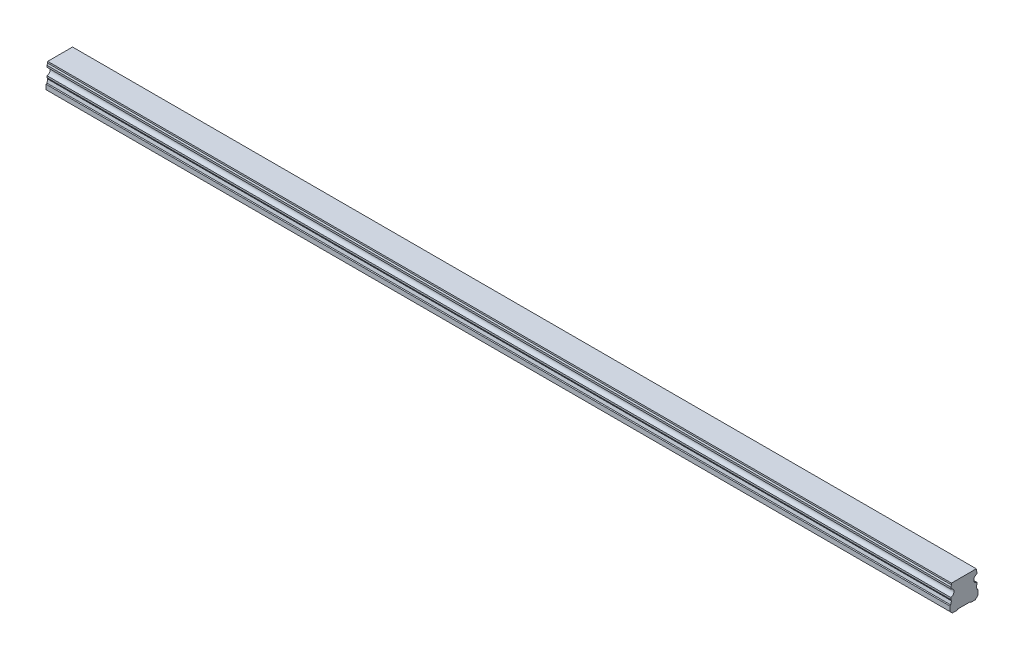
ISO-10303-21;
HEADER;
FILE_DESCRIPTION(('STEP AP214'),'2;1');
FILE_NAME('part.step','',(''),(''),'','','');
FILE_SCHEMA(('AUTOMOTIVE_DESIGN { 1 0 10303 214 1 1 1 1 }'));
ENDSEC;
DATA;
#1=APPLICATION_CONTEXT('core data for automotive mechanical design processes');
#2=APPLICATION_PROTOCOL_DEFINITION('international standard','automotive_design',2000,#1);
#3=PRODUCT_CONTEXT('',#1,'mechanical');
#4=PRODUCT('Part','Part','',(#3));
#5=PRODUCT_RELATED_PRODUCT_CATEGORY('part','',(#4));
#6=PRODUCT_DEFINITION_FORMATION('','',#4);
#7=PRODUCT_DEFINITION_CONTEXT('part definition',#1,'design');
#8=PRODUCT_DEFINITION('design','',#6,#7);
#9=PRODUCT_DEFINITION_SHAPE('','',#8);
#10=(LENGTH_UNIT() NAMED_UNIT(*) SI_UNIT(.MILLI.,.METRE.));
#11=(NAMED_UNIT(*) PLANE_ANGLE_UNIT() SI_UNIT($,.RADIAN.));
#12=(NAMED_UNIT(*) SI_UNIT($,.STERADIAN.) SOLID_ANGLE_UNIT());
#13=UNCERTAINTY_MEASURE_WITH_UNIT(LENGTH_MEASURE(1.E-05),#10,'distance_accuracy_value','');
#14=(GEOMETRIC_REPRESENTATION_CONTEXT(3) GLOBAL_UNCERTAINTY_ASSIGNED_CONTEXT((#13)) GLOBAL_UNIT_ASSIGNED_CONTEXT((#10,
#11,#12)) REPRESENTATION_CONTEXT('',''));
#15=CARTESIAN_POINT('',(0.,0.,0.));
#16=DIRECTION('',(0.,0.,1.));
#17=DIRECTION('',(1.,0.,0.));
#18=AXIS2_PLACEMENT_3D('',#15,#16,#17);
#19=CARTESIAN_POINT('',(450.,0.399999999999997,0.));
#20=DIRECTION('',(0.,-1.,0.));
#21=DIRECTION('',(0.,0.,-1.));
#22=AXIS2_PLACEMENT_3D('',#19,#20,#21);
#23=CONICAL_SURFACE('',#22,2.90000000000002,0.785398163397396);
#24=CARTESIAN_POINT('',(450.,0.800000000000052,0.));
#25=DIRECTION('',(0.,1.,0.));
#26=DIRECTION('',(0.,0.,1.));
#27=AXIS2_PLACEMENT_3D('',#24,#25,#26);
#28=CIRCLE('',#27,2.5);
#29=CARTESIAN_POINT('',(450.,0.800000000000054,2.5));
#30=VERTEX_POINT('',#29);
#31=EDGE_CURVE('E11',#30,#30,#28,.F.);
#32=ORIENTED_EDGE('',*,*,#31,.F.);
#33=EDGE_LOOP('',(#32));
#34=FACE_BOUND('',#33,.T.);
#35=CARTESIAN_POINT('',(450.,0.399999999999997,0.));
#36=DIRECTION('',(0.,1.,0.));
#37=DIRECTION('',(0.,0.,1.));
#38=AXIS2_PLACEMENT_3D('',#35,#36,#37);
#39=CIRCLE('',#38,2.90000000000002);
#40=CARTESIAN_POINT('',(450.,0.399999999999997,2.90000000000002));
#41=VERTEX_POINT('',#40);
#42=EDGE_CURVE('E494',#41,#41,#39,.T.);
#43=ORIENTED_EDGE('',*,*,#42,.F.);
#44=EDGE_LOOP('',(#43));
#45=FACE_BOUND('',#44,.T.);
#46=ADVANCED_FACE('F39',(#34,#45),#23,.F.);
#47=CARTESIAN_POINT('',(450.,7.,0.));
#48=DIRECTION('',(0.,-1.,0.));
#49=DIRECTION('',(0.,0.,-1.));
#50=AXIS2_PLACEMENT_3D('',#47,#48,#49);
#51=CYLINDRICAL_SURFACE('',#50,2.5);
#52=ORIENTED_EDGE('',*,*,#31,.T.);
#53=EDGE_LOOP('',(#52));
#54=FACE_BOUND('',#53,.T.);
#55=CARTESIAN_POINT('',(450.,7.,0.));
#56=DIRECTION('',(0.,-1.,0.));
#57=DIRECTION('',(0.,0.,-1.));
#58=AXIS2_PLACEMENT_3D('',#55,#56,#57);
#59=CIRCLE('',#58,2.5);
#60=CARTESIAN_POINT('',(450.,7.,-2.50000000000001));
#61=VERTEX_POINT('',#60);
#62=EDGE_CURVE('E49',#61,#61,#59,.T.);
#63=ORIENTED_EDGE('',*,*,#62,.F.);
#64=EDGE_LOOP('',(#63));
#65=FACE_BOUND('',#64,.T.);
#66=ADVANCED_FACE('F653',(#54,#65),#51,.F.);
#67=CARTESIAN_POINT('',(450.,7.,0.));
#68=DIRECTION('',(0.,-1.,0.));
#69=DIRECTION('',(0.,0.,-1.));
#70=AXIS2_PLACEMENT_3D('',#67,#68,#69);
#71=PLANE('',#70);
#72=CARTESIAN_POINT('',(450.,7.,0.));
#73=DIRECTION('',(0.,-1.,0.));
#74=DIRECTION('',(0.,0.,-1.));
#75=AXIS2_PLACEMENT_3D('',#72,#73,#74);
#76=CIRCLE('',#75,2.1);
#77=CARTESIAN_POINT('',(450.,7.,-2.1));
#78=VERTEX_POINT('',#77);
#79=EDGE_CURVE('E42',#78,#78,#76,.T.);
#80=ORIENTED_EDGE('',*,*,#79,.F.);
#81=EDGE_LOOP('',(#80));
#82=FACE_BOUND('',#81,.T.);
#83=ORIENTED_EDGE('',*,*,#62,.T.);
#84=EDGE_LOOP('',(#83));
#85=FACE_BOUND('',#84,.T.);
#86=ADVANCED_FACE('F658',(#82,#85),#71,.T.);
#87=CARTESIAN_POINT('',(390.,0.399999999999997,0.));
#88=DIRECTION('',(0.,-1.,0.));
#89=DIRECTION('',(0.,0.,-1.));
#90=AXIS2_PLACEMENT_3D('',#87,#88,#89);
#91=CONICAL_SURFACE('',#90,2.90000000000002,0.785398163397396);
#92=CARTESIAN_POINT('',(390.,0.800000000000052,0.));
#93=DIRECTION('',(0.,1.,0.));
#94=DIRECTION('',(0.,0.,1.));
#95=AXIS2_PLACEMENT_3D('',#92,#93,#94);
#96=CIRCLE('',#95,2.5);
#97=CARTESIAN_POINT('',(390.,0.800000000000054,2.5));
#98=VERTEX_POINT('',#97);
#99=EDGE_CURVE('E490',#98,#98,#96,.F.);
#100=ORIENTED_EDGE('',*,*,#99,.F.);
#101=EDGE_LOOP('',(#100));
#102=FACE_BOUND('',#101,.T.);
#103=CARTESIAN_POINT('',(390.,0.399999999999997,0.));
#104=DIRECTION('',(0.,1.,0.));
#105=DIRECTION('',(0.,0.,1.));
#106=AXIS2_PLACEMENT_3D('',#103,#104,#105);
#107=CIRCLE('',#106,2.90000000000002);
#108=CARTESIAN_POINT('',(390.,0.399999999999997,2.90000000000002));
#109=VERTEX_POINT('',#108);
#110=EDGE_CURVE('E482',#109,#109,#107,.T.);
#111=ORIENTED_EDGE('',*,*,#110,.F.);
#112=EDGE_LOOP('',(#111));
#113=FACE_BOUND('',#112,.T.);
#114=ADVANCED_FACE('F791',(#102,#113),#91,.F.);
#115=CARTESIAN_POINT('',(390.,7.,0.));
#116=DIRECTION('',(0.,-1.,0.));
#117=DIRECTION('',(0.,0.,-1.));
#118=AXIS2_PLACEMENT_3D('',#115,#116,#117);
#119=CYLINDRICAL_SURFACE('',#118,2.5);
#120=ORIENTED_EDGE('',*,*,#99,.T.);
#121=EDGE_LOOP('',(#120));
#122=FACE_BOUND('',#121,.T.);
#123=CARTESIAN_POINT('',(390.,7.,0.));
#124=DIRECTION('',(0.,-1.,0.));
#125=DIRECTION('',(0.,0.,-1.));
#126=AXIS2_PLACEMENT_3D('',#123,#124,#125);
#127=CIRCLE('',#126,2.5);
#128=CARTESIAN_POINT('',(390.,7.,-2.50000000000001));
#129=VERTEX_POINT('',#128);
#130=EDGE_CURVE('E486',#129,#129,#127,.T.);
#131=ORIENTED_EDGE('',*,*,#130,.F.);
#132=EDGE_LOOP('',(#131));
#133=FACE_BOUND('',#132,.T.);
#134=ADVANCED_FACE('F787',(#122,#133),#119,.F.);
#135=CARTESIAN_POINT('',(390.,7.,0.));
#136=DIRECTION('',(0.,-1.,0.));
#137=DIRECTION('',(0.,0.,-1.));
#138=AXIS2_PLACEMENT_3D('',#135,#136,#137);
#139=PLANE('',#138);
#140=CARTESIAN_POINT('',(390.,7.,0.));
#141=DIRECTION('',(0.,-1.,0.));
#142=DIRECTION('',(0.,0.,-1.));
#143=AXIS2_PLACEMENT_3D('',#140,#141,#142);
#144=CIRCLE('',#143,2.1);
#145=CARTESIAN_POINT('',(390.,7.,-2.1));
#146=VERTEX_POINT('',#145);
#147=EDGE_CURVE('E521',#146,#146,#144,.T.);
#148=ORIENTED_EDGE('',*,*,#147,.F.);
#149=EDGE_LOOP('',(#148));
#150=FACE_BOUND('',#149,.T.);
#151=ORIENTED_EDGE('',*,*,#130,.T.);
#152=EDGE_LOOP('',(#151));
#153=FACE_BOUND('',#152,.T.);
#154=ADVANCED_FACE('F783',(#150,#153),#139,.T.);
#155=CARTESIAN_POINT('',(330.,0.399999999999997,0.));
#156=DIRECTION('',(0.,-1.,0.));
#157=DIRECTION('',(0.,0.,-1.));
#158=AXIS2_PLACEMENT_3D('',#155,#156,#157);
#159=CONICAL_SURFACE('',#158,2.90000000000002,0.785398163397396);
#160=CARTESIAN_POINT('',(330.,0.800000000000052,0.));
#161=DIRECTION('',(0.,1.,0.));
#162=DIRECTION('',(0.,0.,1.));
#163=AXIS2_PLACEMENT_3D('',#160,#161,#162);
#164=CIRCLE('',#163,2.5);
#165=CARTESIAN_POINT('',(330.,0.800000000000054,2.5));
#166=VERTEX_POINT('',#165);
#167=EDGE_CURVE('E478',#166,#166,#164,.F.);
#168=ORIENTED_EDGE('',*,*,#167,.F.);
#169=EDGE_LOOP('',(#168));
#170=FACE_BOUND('',#169,.T.);
#171=CARTESIAN_POINT('',(330.,0.399999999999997,0.));
#172=DIRECTION('',(0.,1.,0.));
#173=DIRECTION('',(0.,0.,1.));
#174=AXIS2_PLACEMENT_3D('',#171,#172,#173);
#175=CIRCLE('',#174,2.90000000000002);
#176=CARTESIAN_POINT('',(330.,0.399999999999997,2.90000000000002));
#177=VERTEX_POINT('',#176);
#178=EDGE_CURVE('E470',#177,#177,#175,.T.);
#179=ORIENTED_EDGE('',*,*,#178,.F.);
#180=EDGE_LOOP('',(#179));
#181=FACE_BOUND('',#180,.T.);
#182=ADVANCED_FACE('F779',(#170,#181),#159,.F.);
#183=CARTESIAN_POINT('',(330.,7.,0.));
#184=DIRECTION('',(0.,-1.,0.));
#185=DIRECTION('',(0.,0.,-1.));
#186=AXIS2_PLACEMENT_3D('',#183,#184,#185);
#187=CYLINDRICAL_SURFACE('',#186,2.5);
#188=ORIENTED_EDGE('',*,*,#167,.T.);
#189=EDGE_LOOP('',(#188));
#190=FACE_BOUND('',#189,.T.);
#191=CARTESIAN_POINT('',(330.,7.,0.));
#192=DIRECTION('',(0.,-1.,0.));
#193=DIRECTION('',(0.,0.,-1.));
#194=AXIS2_PLACEMENT_3D('',#191,#192,#193);
#195=CIRCLE('',#194,2.5);
#196=CARTESIAN_POINT('',(330.,7.,-2.50000000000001));
#197=VERTEX_POINT('',#196);
#198=EDGE_CURVE('E474',#197,#197,#195,.T.);
#199=ORIENTED_EDGE('',*,*,#198,.F.);
#200=EDGE_LOOP('',(#199));
#201=FACE_BOUND('',#200,.T.);
#202=ADVANCED_FACE('F775',(#190,#201),#187,.F.);
#203=CARTESIAN_POINT('',(330.,7.,0.));
#204=DIRECTION('',(0.,-1.,0.));
#205=DIRECTION('',(0.,0.,-1.));
#206=AXIS2_PLACEMENT_3D('',#203,#204,#205);
#207=PLANE('',#206);
#208=CARTESIAN_POINT('',(330.,7.,0.));
#209=DIRECTION('',(0.,-1.,0.));
#210=DIRECTION('',(0.,0.,-1.));
#211=AXIS2_PLACEMENT_3D('',#208,#209,#210);
#212=CIRCLE('',#211,2.1);
#213=CARTESIAN_POINT('',(330.,7.,-2.1));
#214=VERTEX_POINT('',#213);
#215=EDGE_CURVE('E518',#214,#214,#212,.T.);
#216=ORIENTED_EDGE('',*,*,#215,.F.);
#217=EDGE_LOOP('',(#216));
#218=FACE_BOUND('',#217,.T.);
#219=ORIENTED_EDGE('',*,*,#198,.T.);
#220=EDGE_LOOP('',(#219));
#221=FACE_BOUND('',#220,.T.);
#222=ADVANCED_FACE('F771',(#218,#221),#207,.T.);
#223=CARTESIAN_POINT('',(270.,0.399999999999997,0.));
#224=DIRECTION('',(0.,-1.,0.));
#225=DIRECTION('',(0.,0.,-1.));
#226=AXIS2_PLACEMENT_3D('',#223,#224,#225);
#227=CONICAL_SURFACE('',#226,2.90000000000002,0.785398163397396);
#228=CARTESIAN_POINT('',(270.,0.800000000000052,0.));
#229=DIRECTION('',(0.,1.,0.));
#230=DIRECTION('',(0.,0.,1.));
#231=AXIS2_PLACEMENT_3D('',#228,#229,#230);
#232=CIRCLE('',#231,2.5);
#233=CARTESIAN_POINT('',(270.,0.800000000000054,2.5));
#234=VERTEX_POINT('',#233);
#235=EDGE_CURVE('E466',#234,#234,#232,.F.);
#236=ORIENTED_EDGE('',*,*,#235,.F.);
#237=EDGE_LOOP('',(#236));
#238=FACE_BOUND('',#237,.T.);
#239=CARTESIAN_POINT('',(270.,0.399999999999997,0.));
#240=DIRECTION('',(0.,1.,0.));
#241=DIRECTION('',(0.,0.,1.));
#242=AXIS2_PLACEMENT_3D('',#239,#240,#241);
#243=CIRCLE('',#242,2.90000000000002);
#244=CARTESIAN_POINT('',(270.,0.399999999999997,2.90000000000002));
#245=VERTEX_POINT('',#244);
#246=EDGE_CURVE('E458',#245,#245,#243,.T.);
#247=ORIENTED_EDGE('',*,*,#246,.F.);
#248=EDGE_LOOP('',(#247));
#249=FACE_BOUND('',#248,.T.);
#250=ADVANCED_FACE('F767',(#238,#249),#227,.F.);
#251=CARTESIAN_POINT('',(270.,7.,0.));
#252=DIRECTION('',(0.,-1.,0.));
#253=DIRECTION('',(0.,0.,-1.));
#254=AXIS2_PLACEMENT_3D('',#251,#252,#253);
#255=CYLINDRICAL_SURFACE('',#254,2.5);
#256=ORIENTED_EDGE('',*,*,#235,.T.);
#257=EDGE_LOOP('',(#256));
#258=FACE_BOUND('',#257,.T.);
#259=CARTESIAN_POINT('',(270.,7.,0.));
#260=DIRECTION('',(0.,-1.,0.));
#261=DIRECTION('',(0.,0.,-1.));
#262=AXIS2_PLACEMENT_3D('',#259,#260,#261);
#263=CIRCLE('',#262,2.5);
#264=CARTESIAN_POINT('',(270.,7.,-2.50000000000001));
#265=VERTEX_POINT('',#264);
#266=EDGE_CURVE('E462',#265,#265,#263,.T.);
#267=ORIENTED_EDGE('',*,*,#266,.F.);
#268=EDGE_LOOP('',(#267));
#269=FACE_BOUND('',#268,.T.);
#270=ADVANCED_FACE('F763',(#258,#269),#255,.F.);
#271=CARTESIAN_POINT('',(270.,7.,0.));
#272=DIRECTION('',(0.,-1.,0.));
#273=DIRECTION('',(0.,0.,-1.));
#274=AXIS2_PLACEMENT_3D('',#271,#272,#273);
#275=PLANE('',#274);
#276=CARTESIAN_POINT('',(270.,7.,0.));
#277=DIRECTION('',(0.,-1.,0.));
#278=DIRECTION('',(0.,0.,-1.));
#279=AXIS2_PLACEMENT_3D('',#276,#277,#278);
#280=CIRCLE('',#279,2.1);
#281=CARTESIAN_POINT('',(270.,7.,-2.1));
#282=VERTEX_POINT('',#281);
#283=EDGE_CURVE('E514',#282,#282,#280,.T.);
#284=ORIENTED_EDGE('',*,*,#283,.F.);
#285=EDGE_LOOP('',(#284));
#286=FACE_BOUND('',#285,.T.);
#287=ORIENTED_EDGE('',*,*,#266,.T.);
#288=EDGE_LOOP('',(#287));
#289=FACE_BOUND('',#288,.T.);
#290=ADVANCED_FACE('F759',(#286,#289),#275,.T.);
#291=CARTESIAN_POINT('',(210.,0.399999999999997,0.));
#292=DIRECTION('',(0.,-1.,0.));
#293=DIRECTION('',(0.,0.,-1.));
#294=AXIS2_PLACEMENT_3D('',#291,#292,#293);
#295=CONICAL_SURFACE('',#294,2.90000000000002,0.785398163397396);
#296=CARTESIAN_POINT('',(210.,0.800000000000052,0.));
#297=DIRECTION('',(0.,1.,0.));
#298=DIRECTION('',(0.,0.,1.));
#299=AXIS2_PLACEMENT_3D('',#296,#297,#298);
#300=CIRCLE('',#299,2.5);
#301=CARTESIAN_POINT('',(210.,0.800000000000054,2.5));
#302=VERTEX_POINT('',#301);
#303=EDGE_CURVE('E454',#302,#302,#300,.F.);
#304=ORIENTED_EDGE('',*,*,#303,.F.);
#305=EDGE_LOOP('',(#304));
#306=FACE_BOUND('',#305,.T.);
#307=CARTESIAN_POINT('',(210.,0.399999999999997,0.));
#308=DIRECTION('',(0.,1.,0.));
#309=DIRECTION('',(0.,0.,1.));
#310=AXIS2_PLACEMENT_3D('',#307,#308,#309);
#311=CIRCLE('',#310,2.90000000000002);
#312=CARTESIAN_POINT('',(210.,0.399999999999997,2.90000000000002));
#313=VERTEX_POINT('',#312);
#314=EDGE_CURVE('E446',#313,#313,#311,.T.);
#315=ORIENTED_EDGE('',*,*,#314,.F.);
#316=EDGE_LOOP('',(#315));
#317=FACE_BOUND('',#316,.T.);
#318=ADVANCED_FACE('F755',(#306,#317),#295,.F.);
#319=CARTESIAN_POINT('',(210.,7.,0.));
#320=DIRECTION('',(0.,-1.,0.));
#321=DIRECTION('',(0.,0.,-1.));
#322=AXIS2_PLACEMENT_3D('',#319,#320,#321);
#323=CYLINDRICAL_SURFACE('',#322,2.5);
#324=ORIENTED_EDGE('',*,*,#303,.T.);
#325=EDGE_LOOP('',(#324));
#326=FACE_BOUND('',#325,.T.);
#327=CARTESIAN_POINT('',(210.,7.,0.));
#328=DIRECTION('',(0.,-1.,0.));
#329=DIRECTION('',(0.,0.,-1.));
#330=AXIS2_PLACEMENT_3D('',#327,#328,#329);
#331=CIRCLE('',#330,2.5);
#332=CARTESIAN_POINT('',(210.,7.,-2.50000000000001));
#333=VERTEX_POINT('',#332);
#334=EDGE_CURVE('E450',#333,#333,#331,.T.);
#335=ORIENTED_EDGE('',*,*,#334,.F.);
#336=EDGE_LOOP('',(#335));
#337=FACE_BOUND('',#336,.T.);
#338=ADVANCED_FACE('F751',(#326,#337),#323,.F.);
#339=CARTESIAN_POINT('',(210.,7.,0.));
#340=DIRECTION('',(0.,-1.,0.));
#341=DIRECTION('',(0.,0.,-1.));
#342=AXIS2_PLACEMENT_3D('',#339,#340,#341);
#343=PLANE('',#342);
#344=CARTESIAN_POINT('',(210.,7.,0.));
#345=DIRECTION('',(0.,-1.,0.));
#346=DIRECTION('',(0.,0.,-1.));
#347=AXIS2_PLACEMENT_3D('',#344,#345,#346);
#348=CIRCLE('',#347,2.1);
#349=CARTESIAN_POINT('',(210.,7.,-2.1));
#350=VERTEX_POINT('',#349);
#351=EDGE_CURVE('E510',#350,#350,#348,.T.);
#352=ORIENTED_EDGE('',*,*,#351,.F.);
#353=EDGE_LOOP('',(#352));
#354=FACE_BOUND('',#353,.T.);
#355=ORIENTED_EDGE('',*,*,#334,.T.);
#356=EDGE_LOOP('',(#355));
#357=FACE_BOUND('',#356,.T.);
#358=ADVANCED_FACE('F747',(#354,#357),#343,.T.);
#359=CARTESIAN_POINT('',(150.,0.399999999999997,0.));
#360=DIRECTION('',(0.,-1.,0.));
#361=DIRECTION('',(0.,0.,-1.));
#362=AXIS2_PLACEMENT_3D('',#359,#360,#361);
#363=CONICAL_SURFACE('',#362,2.90000000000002,0.785398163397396);
#364=CARTESIAN_POINT('',(150.,0.800000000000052,0.));
#365=DIRECTION('',(0.,1.,0.));
#366=DIRECTION('',(0.,0.,1.));
#367=AXIS2_PLACEMENT_3D('',#364,#365,#366);
#368=CIRCLE('',#367,2.5);
#369=CARTESIAN_POINT('',(150.,0.800000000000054,2.5));
#370=VERTEX_POINT('',#369);
#371=EDGE_CURVE('E442',#370,#370,#368,.F.);
#372=ORIENTED_EDGE('',*,*,#371,.F.);
#373=EDGE_LOOP('',(#372));
#374=FACE_BOUND('',#373,.T.);
#375=CARTESIAN_POINT('',(150.,0.399999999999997,0.));
#376=DIRECTION('',(0.,1.,0.));
#377=DIRECTION('',(0.,0.,1.));
#378=AXIS2_PLACEMENT_3D('',#375,#376,#377);
#379=CIRCLE('',#378,2.90000000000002);
#380=CARTESIAN_POINT('',(150.,0.399999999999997,2.90000000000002));
#381=VERTEX_POINT('',#380);
#382=EDGE_CURVE('E434',#381,#381,#379,.T.);
#383=ORIENTED_EDGE('',*,*,#382,.F.);
#384=EDGE_LOOP('',(#383));
#385=FACE_BOUND('',#384,.T.);
#386=ADVANCED_FACE('F743',(#374,#385),#363,.F.);
#387=CARTESIAN_POINT('',(150.,7.,0.));
#388=DIRECTION('',(0.,-1.,0.));
#389=DIRECTION('',(0.,0.,-1.));
#390=AXIS2_PLACEMENT_3D('',#387,#388,#389);
#391=CYLINDRICAL_SURFACE('',#390,2.5);
#392=ORIENTED_EDGE('',*,*,#371,.T.);
#393=EDGE_LOOP('',(#392));
#394=FACE_BOUND('',#393,.T.);
#395=CARTESIAN_POINT('',(150.,7.,0.));
#396=DIRECTION('',(0.,-1.,0.));
#397=DIRECTION('',(0.,0.,-1.));
#398=AXIS2_PLACEMENT_3D('',#395,#396,#397);
#399=CIRCLE('',#398,2.5);
#400=CARTESIAN_POINT('',(150.,7.,-2.50000000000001));
#401=VERTEX_POINT('',#400);
#402=EDGE_CURVE('E438',#401,#401,#399,.T.);
#403=ORIENTED_EDGE('',*,*,#402,.F.);
#404=EDGE_LOOP('',(#403));
#405=FACE_BOUND('',#404,.T.);
#406=ADVANCED_FACE('F739',(#394,#405),#391,.F.);
#407=CARTESIAN_POINT('',(150.,7.,0.));
#408=DIRECTION('',(0.,-1.,0.));
#409=DIRECTION('',(0.,0.,-1.));
#410=AXIS2_PLACEMENT_3D('',#407,#408,#409);
#411=PLANE('',#410);
#412=CARTESIAN_POINT('',(150.,7.,0.));
#413=DIRECTION('',(0.,-1.,0.));
#414=DIRECTION('',(0.,0.,-1.));
#415=AXIS2_PLACEMENT_3D('',#412,#413,#414);
#416=CIRCLE('',#415,2.1);
#417=CARTESIAN_POINT('',(150.,7.,-2.1));
#418=VERTEX_POINT('',#417);
#419=EDGE_CURVE('E505',#418,#418,#416,.T.);
#420=ORIENTED_EDGE('',*,*,#419,.F.);
#421=EDGE_LOOP('',(#420));
#422=FACE_BOUND('',#421,.T.);
#423=ORIENTED_EDGE('',*,*,#402,.T.);
#424=EDGE_LOOP('',(#423));
#425=FACE_BOUND('',#424,.T.);
#426=ADVANCED_FACE('F730',(#422,#425),#411,.T.);
#427=CARTESIAN_POINT('',(480.,14.,-6.59000000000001));
#428=DIRECTION('',(0.,0.,1.));
#429=DIRECTION('',(0.,-1.,0.));
#430=AXIS2_PLACEMENT_3D('',#427,#428,#429);
#431=PLANE('',#430);
#432=DIRECTION('',(0.,1.,0.));
#433=VECTOR('',#432,1.);
#434=CARTESIAN_POINT('',(0.,14.,-6.59000000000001));
#435=LINE('',#434,#433);
#436=CARTESIAN_POINT('',(0.,13.15,-6.59));
#437=VERTEX_POINT('',#436);
#438=CARTESIAN_POINT('',(0.,14.,-6.59000000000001));
#439=VERTEX_POINT('',#438);
#440=EDGE_CURVE('E255',#437,#439,#435,.T.);
#441=ORIENTED_EDGE('',*,*,#440,.T.);
#442=DIRECTION('',(-1.,0.,0.));
#443=VECTOR('',#442,1.);
#444=CARTESIAN_POINT('',(480.,14.,-6.59000000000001));
#445=LINE('',#444,#443);
#446=CARTESIAN_POINT('',(480.,14.,-6.59000000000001));
#447=VERTEX_POINT('',#446);
#448=EDGE_CURVE('E423',#447,#439,#445,.T.);
#449=ORIENTED_EDGE('',*,*,#448,.F.);
#450=DIRECTION('',(0.,1.,0.));
#451=VECTOR('',#450,1.);
#452=CARTESIAN_POINT('',(480.,14.,-6.59000000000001));
#453=LINE('',#452,#451);
#454=CARTESIAN_POINT('',(480.,13.15,-6.59));
#455=VERTEX_POINT('',#454);
#456=EDGE_CURVE('E332',#455,#447,#453,.T.);
#457=ORIENTED_EDGE('',*,*,#456,.F.);
#458=DIRECTION('',(-1.,0.,0.));
#459=VECTOR('',#458,1.);
#460=CARTESIAN_POINT('',(480.,13.15,-6.59));
#461=LINE('',#460,#459);
#462=EDGE_CURVE('E251',#455,#437,#461,.T.);
#463=ORIENTED_EDGE('',*,*,#462,.T.);
#464=EDGE_LOOP('',(#441,#449,#457,#463));
#465=FACE_BOUND('',#464,.T.);
#466=ADVANCED_FACE('F640',(#465),#431,.F.);
#467=CARTESIAN_POINT('',(480.,14.,-6.59000000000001));
#468=DIRECTION('',(0.,-1.,0.));
#469=DIRECTION('',(0.,0.,-1.));
#470=AXIS2_PLACEMENT_3D('',#467,#468,#469);
#471=PLANE('',#470);
#472=DIRECTION('',(0.,0.,1.));
#473=VECTOR('',#472,1.);
#474=CARTESIAN_POINT('',(0.,14.,-6.59000000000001));
#475=LINE('',#474,#473);
#476=CARTESIAN_POINT('',(0.,14.,6.59));
#477=VERTEX_POINT('',#476);
#478=EDGE_CURVE('E259',#439,#477,#475,.T.);
#479=ORIENTED_EDGE('',*,*,#478,.T.);
#480=DIRECTION('',(-1.,0.,0.));
#481=VECTOR('',#480,1.);
#482=CARTESIAN_POINT('',(480.,14.,6.59));
#483=LINE('',#482,#481);
#484=CARTESIAN_POINT('',(480.,14.,6.59));
#485=VERTEX_POINT('',#484);
#486=EDGE_CURVE('E419',#485,#477,#483,.T.);
#487=ORIENTED_EDGE('',*,*,#486,.F.);
#488=DIRECTION('',(0.,0.,1.));
#489=VECTOR('',#488,1.);
#490=CARTESIAN_POINT('',(480.,14.,-6.59000000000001));
#491=LINE('',#490,#489);
#492=EDGE_CURVE('E157',#447,#485,#491,.T.);
#493=ORIENTED_EDGE('',*,*,#492,.F.);
#494=ORIENTED_EDGE('',*,*,#448,.T.);
#495=EDGE_LOOP('',(#479,#487,#493,#494));
#496=FACE_BOUND('',#495,.T.);
#497=ADVANCED_FACE('F724',(#496),#471,.F.);
#498=CARTESIAN_POINT('',(480.,14.,6.59));
#499=DIRECTION('',(0.,0.,-1.));
#500=DIRECTION('',(0.,1.,0.));
#501=AXIS2_PLACEMENT_3D('',#498,#499,#500);
#502=PLANE('',#501);
#503=DIRECTION('',(0.,-1.,0.));
#504=VECTOR('',#503,1.);
#505=CARTESIAN_POINT('',(0.,14.,6.59));
#506=LINE('',#505,#504);
#507=CARTESIAN_POINT('',(0.,13.15,6.59));
#508=VERTEX_POINT('',#507);
#509=EDGE_CURVE('E263',#477,#508,#506,.T.);
#510=ORIENTED_EDGE('',*,*,#509,.T.);
#511=DIRECTION('',(-1.,0.,0.));
#512=VECTOR('',#511,1.);
#513=CARTESIAN_POINT('',(480.,13.15,6.59));
#514=LINE('',#513,#512);
#515=CARTESIAN_POINT('',(480.,13.15,6.59));
#516=VERTEX_POINT('',#515);
#517=EDGE_CURVE('E415',#516,#508,#514,.T.);
#518=ORIENTED_EDGE('',*,*,#517,.F.);
#519=DIRECTION('',(0.,-1.,0.));
#520=VECTOR('',#519,1.);
#521=CARTESIAN_POINT('',(480.,14.,6.59));
#522=LINE('',#521,#520);
#523=EDGE_CURVE('E566',#485,#516,#522,.T.);
#524=ORIENTED_EDGE('',*,*,#523,.F.);
#525=ORIENTED_EDGE('',*,*,#486,.T.);
#526=EDGE_LOOP('',(#510,#518,#524,#525));
#527=FACE_BOUND('',#526,.T.);
#528=ADVANCED_FACE('F720',(#527),#502,.F.);
#529=CARTESIAN_POINT('',(480.,13.15,6.59));
#530=DIRECTION('',(0.,-0.422618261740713,-0.906307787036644));
#531=DIRECTION('',(0.,0.906307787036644,-0.422618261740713));
#532=AXIS2_PLACEMENT_3D('',#529,#530,#531);
#533=PLANE('',#532);
#534=DIRECTION('',(0.,-0.906307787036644,0.422618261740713));
#535=VECTOR('',#534,1.);
#536=CARTESIAN_POINT('',(0.,13.15,6.59));
#537=LINE('',#536,#535);
#538=CARTESIAN_POINT('',(0.,12.3565324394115,6.96));
#539=VERTEX_POINT('',#538);
#540=EDGE_CURVE('E266',#508,#539,#537,.T.);
#541=ORIENTED_EDGE('',*,*,#540,.T.);
#542=DIRECTION('',(-1.,0.,0.));
#543=VECTOR('',#542,1.);
#544=CARTESIAN_POINT('',(480.,12.3565324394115,6.96));
#545=LINE('',#544,#543);
#546=CARTESIAN_POINT('',(480.,12.3565324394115,6.96));
#547=VERTEX_POINT('',#546);
#548=EDGE_CURVE('E411',#547,#539,#545,.T.);
#549=ORIENTED_EDGE('',*,*,#548,.F.);
#550=DIRECTION('',(0.,-0.906307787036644,0.422618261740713));
#551=VECTOR('',#550,1.);
#552=CARTESIAN_POINT('',(480.,13.15,6.59));
#553=LINE('',#552,#551);
#554=EDGE_CURVE('E569',#516,#547,#553,.T.);
#555=ORIENTED_EDGE('',*,*,#554,.F.);
#556=ORIENTED_EDGE('',*,*,#517,.T.);
#557=EDGE_LOOP('',(#541,#549,#555,#556));
#558=FACE_BOUND('',#557,.T.);
#559=ADVANCED_FACE('F716',(#558),#533,.F.);
#560=CARTESIAN_POINT('',(480.,12.3565324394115,6.96));
#561=DIRECTION('',(0.,0.,-1.));
#562=DIRECTION('',(0.,1.,0.));
#563=AXIS2_PLACEMENT_3D('',#560,#561,#562);
#564=PLANE('',#563);
#565=DIRECTION('',(0.,-1.,0.));
#566=VECTOR('',#565,1.);
#567=CARTESIAN_POINT('',(0.,12.3565324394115,6.96));
#568=LINE('',#567,#566);
#569=CARTESIAN_POINT('',(0.,11.4351744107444,6.96));
#570=VERTEX_POINT('',#569);
#571=EDGE_CURVE('E269',#539,#570,#568,.T.);
#572=ORIENTED_EDGE('',*,*,#571,.T.);
#573=DIRECTION('',(-1.,0.,0.));
#574=VECTOR('',#573,1.);
#575=CARTESIAN_POINT('',(480.,11.4351744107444,6.96));
#576=LINE('',#575,#574);
#577=CARTESIAN_POINT('',(480.,11.4351744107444,6.96));
#578=VERTEX_POINT('',#577);
#579=EDGE_CURVE('E407',#578,#570,#576,.T.);
#580=ORIENTED_EDGE('',*,*,#579,.F.);
#581=DIRECTION('',(0.,-1.,0.));
#582=VECTOR('',#581,1.);
#583=CARTESIAN_POINT('',(480.,12.3565324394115,6.96));
#584=LINE('',#583,#582);
#585=EDGE_CURVE('E572',#547,#578,#584,.T.);
#586=ORIENTED_EDGE('',*,*,#585,.F.);
#587=ORIENTED_EDGE('',*,*,#548,.T.);
#588=EDGE_LOOP('',(#572,#580,#586,#587));
#589=FACE_BOUND('',#588,.T.);
#590=ADVANCED_FACE('F712',(#589),#564,.F.);
#591=CARTESIAN_POINT('',(480.,9.5,7.2));
#592=DIRECTION('',(-1.,0.,0.));
#593=DIRECTION('',(0.,0.,1.));
#594=AXIS2_PLACEMENT_3D('',#591,#592,#593);
#595=CYLINDRICAL_SURFACE('',#594,1.95);
#596=CARTESIAN_POINT('',(0.,9.5,7.2));
#597=DIRECTION('',(-1.,0.,0.));
#598=DIRECTION('',(0.,0.,-1.));
#599=AXIS2_PLACEMENT_3D('',#596,#597,#598);
#600=CIRCLE('',#599,1.95);
#601=CARTESIAN_POINT('',(0.,7.56482558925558,6.96));
#602=VERTEX_POINT('',#601);
#603=EDGE_CURVE('E272',#570,#602,#600,.T.);
#604=ORIENTED_EDGE('',*,*,#603,.T.);
#605=DIRECTION('',(-1.,0.,0.));
#606=VECTOR('',#605,1.);
#607=CARTESIAN_POINT('',(480.,7.56482558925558,6.96));
#608=LINE('',#607,#606);
#609=CARTESIAN_POINT('',(480.,7.56482558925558,6.96));
#610=VERTEX_POINT('',#609);
#611=EDGE_CURVE('E403',#610,#602,#608,.T.);
#612=ORIENTED_EDGE('',*,*,#611,.F.);
#613=CARTESIAN_POINT('',(480.,9.5,7.2));
#614=DIRECTION('',(-1.,0.,0.));
#615=DIRECTION('',(0.,0.,-1.));
#616=AXIS2_PLACEMENT_3D('',#613,#614,#615);
#617=CIRCLE('',#616,1.95);
#618=EDGE_CURVE('E575',#578,#610,#617,.T.);
#619=ORIENTED_EDGE('',*,*,#618,.F.);
#620=ORIENTED_EDGE('',*,*,#579,.T.);
#621=EDGE_LOOP('',(#604,#612,#619,#620));
#622=FACE_BOUND('',#621,.T.);
#623=ADVANCED_FACE('F708',(#622),#595,.F.);
#624=CARTESIAN_POINT('',(480.,7.56482558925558,6.96));
#625=DIRECTION('',(0.,0.,-1.));
#626=DIRECTION('',(0.,1.,0.));
#627=AXIS2_PLACEMENT_3D('',#624,#625,#626);
#628=PLANE('',#627);
#629=DIRECTION('',(0.,-1.,0.));
#630=VECTOR('',#629,1.);
#631=CARTESIAN_POINT('',(0.,7.56482558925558,6.96));
#632=LINE('',#631,#630);
#633=CARTESIAN_POINT('',(0.,6.64346756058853,6.96));
#634=VERTEX_POINT('',#633);
#635=EDGE_CURVE('E275',#602,#634,#632,.T.);
#636=ORIENTED_EDGE('',*,*,#635,.T.);
#637=DIRECTION('',(-1.,0.,0.));
#638=VECTOR('',#637,1.);
#639=CARTESIAN_POINT('',(480.,6.64346756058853,6.96));
#640=LINE('',#639,#638);
#641=CARTESIAN_POINT('',(480.,6.64346756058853,6.96));
#642=VERTEX_POINT('',#641);
#643=EDGE_CURVE('E399',#642,#634,#640,.T.);
#644=ORIENTED_EDGE('',*,*,#643,.F.);
#645=DIRECTION('',(0.,-1.,0.));
#646=VECTOR('',#645,1.);
#647=CARTESIAN_POINT('',(480.,7.56482558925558,6.96));
#648=LINE('',#647,#646);
#649=EDGE_CURVE('E578',#610,#642,#648,.T.);
#650=ORIENTED_EDGE('',*,*,#649,.F.);
#651=ORIENTED_EDGE('',*,*,#611,.T.);
#652=EDGE_LOOP('',(#636,#644,#650,#651));
#653=FACE_BOUND('',#652,.T.);
#654=ADVANCED_FACE('F704',(#653),#628,.F.);
#655=CARTESIAN_POINT('',(480.,6.64346756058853,6.96));
#656=DIRECTION('',(0.,0.422618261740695,-0.906307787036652));
#657=DIRECTION('',(0.,0.906307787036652,0.422618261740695));
#658=AXIS2_PLACEMENT_3D('',#655,#656,#657);
#659=PLANE('',#658);
#660=DIRECTION('',(0.,-0.906307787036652,-0.422618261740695));
#661=VECTOR('',#660,1.);
#662=CARTESIAN_POINT('',(0.,6.64346756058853,6.96));
#663=LINE('',#662,#661);
#664=CARTESIAN_POINT('',(0.,5.85,6.59000000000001));
#665=VERTEX_POINT('',#664);
#666=EDGE_CURVE('E278',#634,#665,#663,.T.);
#667=ORIENTED_EDGE('',*,*,#666,.T.);
#668=DIRECTION('',(-1.,0.,0.));
#669=VECTOR('',#668,1.);
#670=CARTESIAN_POINT('',(480.,5.85,6.59000000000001));
#671=LINE('',#670,#669);
#672=CARTESIAN_POINT('',(480.,5.85,6.59000000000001));
#673=VERTEX_POINT('',#672);
#674=EDGE_CURVE('E395',#673,#665,#671,.T.);
#675=ORIENTED_EDGE('',*,*,#674,.F.);
#676=DIRECTION('',(0.,-0.906307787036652,-0.422618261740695));
#677=VECTOR('',#676,1.);
#678=CARTESIAN_POINT('',(480.,6.64346756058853,6.96));
#679=LINE('',#678,#677);
#680=EDGE_CURVE('E581',#642,#673,#679,.T.);
#681=ORIENTED_EDGE('',*,*,#680,.F.);
#682=ORIENTED_EDGE('',*,*,#643,.T.);
#683=EDGE_LOOP('',(#667,#675,#681,#682));
#684=FACE_BOUND('',#683,.T.);
#685=ADVANCED_FACE('F700',(#684),#659,.F.);
#686=CARTESIAN_POINT('',(480.,5.85,6.59000000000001));
#687=DIRECTION('',(0.,-0.25881904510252,-0.965925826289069));
#688=DIRECTION('',(0.,0.965925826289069,-0.25881904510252));
#689=AXIS2_PLACEMENT_3D('',#686,#687,#688);
#690=PLANE('',#689);
#691=DIRECTION('',(0.,-0.965925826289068,0.25881904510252));
#692=VECTOR('',#691,1.);
#693=CARTESIAN_POINT('',(0.,5.85,6.59000000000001));
#694=LINE('',#693,#692);
#695=CARTESIAN_POINT('',(0.,4.2,7.03211616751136));
#696=VERTEX_POINT('',#695);
#697=EDGE_CURVE('E281',#665,#696,#694,.T.);
#698=ORIENTED_EDGE('',*,*,#697,.T.);
#699=DIRECTION('',(-1.,0.,0.));
#700=VECTOR('',#699,1.);
#701=CARTESIAN_POINT('',(480.,4.2,7.03211616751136));
#702=LINE('',#701,#700);
#703=CARTESIAN_POINT('',(480.,4.2,7.03211616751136));
#704=VERTEX_POINT('',#703);
#705=EDGE_CURVE('E391',#704,#696,#702,.T.);
#706=ORIENTED_EDGE('',*,*,#705,.F.);
#707=DIRECTION('',(0.,-0.965925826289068,0.25881904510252));
#708=VECTOR('',#707,1.);
#709=CARTESIAN_POINT('',(480.,5.85,6.59000000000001));
#710=LINE('',#709,#708);
#711=EDGE_CURVE('E584',#673,#704,#710,.T.);
#712=ORIENTED_EDGE('',*,*,#711,.F.);
#713=ORIENTED_EDGE('',*,*,#674,.T.);
#714=EDGE_LOOP('',(#698,#706,#712,#713));
#715=FACE_BOUND('',#714,.T.);
#716=ADVANCED_FACE('F696',(#715),#690,.F.);
#717=CARTESIAN_POINT('',(480.,4.2,7.03211616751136));
#718=DIRECTION('',(0.,-0.866025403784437,-0.500000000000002));
#719=DIRECTION('',(0.,0.500000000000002,-0.866025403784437));
#720=AXIS2_PLACEMENT_3D('',#717,#718,#719);
#721=PLANE('',#720);
#722=DIRECTION('',(0.,-0.500000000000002,0.866025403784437));
#723=VECTOR('',#722,1.);
#724=CARTESIAN_POINT('',(0.,4.2,7.03211616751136));
#725=LINE('',#724,#723);
#726=CARTESIAN_POINT('',(0.,3.92986714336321,7.5));
#727=VERTEX_POINT('',#726);
#728=EDGE_CURVE('E284',#696,#727,#725,.T.);
#729=ORIENTED_EDGE('',*,*,#728,.T.);
#730=DIRECTION('',(-1.,0.,0.));
#731=VECTOR('',#730,1.);
#732=CARTESIAN_POINT('',(480.,3.92986714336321,7.5));
#733=LINE('',#732,#731);
#734=CARTESIAN_POINT('',(480.,3.92986714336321,7.5));
#735=VERTEX_POINT('',#734);
#736=EDGE_CURVE('E387',#735,#727,#733,.T.);
#737=ORIENTED_EDGE('',*,*,#736,.F.);
#738=DIRECTION('',(0.,-0.500000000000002,0.866025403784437));
#739=VECTOR('',#738,1.);
#740=CARTESIAN_POINT('',(480.,4.2,7.03211616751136));
#741=LINE('',#740,#739);
#742=EDGE_CURVE('E587',#704,#735,#741,.T.);
#743=ORIENTED_EDGE('',*,*,#742,.F.);
#744=ORIENTED_EDGE('',*,*,#705,.T.);
#745=EDGE_LOOP('',(#729,#737,#743,#744));
#746=FACE_BOUND('',#745,.T.);
#747=ADVANCED_FACE('F692',(#746),#721,.F.);
#748=CARTESIAN_POINT('',(480.,3.92986714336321,7.5));
#749=DIRECTION('',(0.,0.,-1.));
#750=DIRECTION('',(0.,1.,0.));
#751=AXIS2_PLACEMENT_3D('',#748,#749,#750);
#752=PLANE('',#751);
#753=DIRECTION('',(0.,-1.,0.));
#754=VECTOR('',#753,1.);
#755=CARTESIAN_POINT('',(0.,3.92986714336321,7.5));
#756=LINE('',#755,#754);
#757=CARTESIAN_POINT('',(0.,1.4,7.5));
#758=VERTEX_POINT('',#757);
#759=EDGE_CURVE('E287',#727,#758,#756,.T.);
#760=ORIENTED_EDGE('',*,*,#759,.T.);
#761=DIRECTION('',(-1.,0.,0.));
#762=VECTOR('',#761,1.);
#763=CARTESIAN_POINT('',(480.,1.4,7.5));
#764=LINE('',#763,#762);
#765=CARTESIAN_POINT('',(480.,1.4,7.5));
#766=VERTEX_POINT('',#765);
#767=EDGE_CURVE('E383',#766,#758,#764,.T.);
#768=ORIENTED_EDGE('',*,*,#767,.F.);
#769=DIRECTION('',(0.,-1.,0.));
#770=VECTOR('',#769,1.);
#771=CARTESIAN_POINT('',(480.,3.92986714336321,7.5));
#772=LINE('',#771,#770);
#773=EDGE_CURVE('E590',#735,#766,#772,.T.);
#774=ORIENTED_EDGE('',*,*,#773,.F.);
#775=ORIENTED_EDGE('',*,*,#736,.T.);
#776=EDGE_LOOP('',(#760,#768,#774,#775));
#777=FACE_BOUND('',#776,.T.);
#778=ADVANCED_FACE('F688',(#777),#752,.F.);
#779=CARTESIAN_POINT('',(480.,1.4,7.5));
#780=DIRECTION('',(0.,0.70710678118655,-0.707106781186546));
#781=DIRECTION('',(0.,0.707106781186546,0.70710678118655));
#782=AXIS2_PLACEMENT_3D('',#779,#780,#781);
#783=PLANE('',#782);
#784=DIRECTION('',(0.,-0.707106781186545,-0.70710678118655));
#785=VECTOR('',#784,1.);
#786=CARTESIAN_POINT('',(0.,1.4,7.5));
#787=LINE('',#786,#785);
#788=CARTESIAN_POINT('',(0.,0.,6.1));
#789=VERTEX_POINT('',#788);
#790=EDGE_CURVE('E290',#758,#789,#787,.T.);
#791=ORIENTED_EDGE('',*,*,#790,.T.);
#792=DIRECTION('',(-1.,0.,0.));
#793=VECTOR('',#792,1.);
#794=CARTESIAN_POINT('',(480.,0.,6.1));
#795=LINE('',#794,#793);
#796=CARTESIAN_POINT('',(480.,0.,6.1));
#797=VERTEX_POINT('',#796);
#798=EDGE_CURVE('E379',#797,#789,#795,.T.);
#799=ORIENTED_EDGE('',*,*,#798,.F.);
#800=DIRECTION('',(0.,-0.707106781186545,-0.70710678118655));
#801=VECTOR('',#800,1.);
#802=CARTESIAN_POINT('',(480.,1.4,7.5));
#803=LINE('',#802,#801);
#804=EDGE_CURVE('E593',#766,#797,#803,.T.);
#805=ORIENTED_EDGE('',*,*,#804,.F.);
#806=ORIENTED_EDGE('',*,*,#767,.T.);
#807=EDGE_LOOP('',(#791,#799,#805,#806));
#808=FACE_BOUND('',#807,.T.);
#809=ADVANCED_FACE('F684',(#808),#783,.F.);
#810=CARTESIAN_POINT('',(480.,0.,6.1));
#811=DIRECTION('',(0.,1.,0.));
#812=DIRECTION('',(0.,0.,1.));
#813=AXIS2_PLACEMENT_3D('',#810,#811,#812);
#814=PLANE('',#813);
#815=DIRECTION('',(0.,0.,-1.));
#816=VECTOR('',#815,1.);
#817=CARTESIAN_POINT('',(0.,0.,6.1));
#818=LINE('',#817,#816);
#819=CARTESIAN_POINT('',(0.,0.,3.65));
#820=VERTEX_POINT('',#819);
#821=EDGE_CURVE('E293',#789,#820,#818,.T.);
#822=ORIENTED_EDGE('',*,*,#821,.T.);
#823=DIRECTION('',(-1.,0.,0.));
#824=VECTOR('',#823,1.);
#825=CARTESIAN_POINT('',(480.,0.,3.65));
#826=LINE('',#825,#824);
#827=CARTESIAN_POINT('',(480.,0.,3.65));
#828=VERTEX_POINT('',#827);
#829=EDGE_CURVE('E375',#828,#820,#826,.T.);
#830=ORIENTED_EDGE('',*,*,#829,.F.);
#831=DIRECTION('',(0.,0.,-1.));
#832=VECTOR('',#831,1.);
#833=CARTESIAN_POINT('',(480.,0.,6.1));
#834=LINE('',#833,#832);
#835=EDGE_CURVE('E596',#797,#828,#834,.T.);
#836=ORIENTED_EDGE('',*,*,#835,.F.);
#837=ORIENTED_EDGE('',*,*,#798,.T.);
#838=EDGE_LOOP('',(#822,#830,#836,#837));
#839=FACE_BOUND('',#838,.T.);
#840=ADVANCED_FACE('F676',(#839),#814,.F.);
#841=CARTESIAN_POINT('',(480.,0.,3.65));
#842=DIRECTION('',(0.,0.707106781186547,0.707106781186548));
#843=DIRECTION('',(0.,-0.707106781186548,0.707106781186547));
#844=AXIS2_PLACEMENT_3D('',#841,#842,#843);
#845=PLANE('',#844);
#846=DIRECTION('',(0.,0.707106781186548,-0.707106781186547));
#847=VECTOR('',#846,1.);
#848=CARTESIAN_POINT('',(0.,0.,3.65));
#849=LINE('',#848,#847);
#850=CARTESIAN_POINT('',(0.,0.399999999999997,3.25));
#851=VERTEX_POINT('',#850);
#852=EDGE_CURVE('E296',#820,#851,#849,.T.);
#853=ORIENTED_EDGE('',*,*,#852,.T.);
#854=DIRECTION('',(-1.,0.,0.));
#855=VECTOR('',#854,1.);
#856=CARTESIAN_POINT('',(480.,0.399999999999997,3.25));
#857=LINE('',#856,#855);
#858=CARTESIAN_POINT('',(480.,0.399999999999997,3.25));
#859=VERTEX_POINT('',#858);
#860=EDGE_CURVE('E371',#859,#851,#857,.T.);
#861=ORIENTED_EDGE('',*,*,#860,.F.);
#862=DIRECTION('',(0.,0.707106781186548,-0.707106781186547));
#863=VECTOR('',#862,1.);
#864=CARTESIAN_POINT('',(480.,0.,3.65));
#865=LINE('',#864,#863);
#866=EDGE_CURVE('E598',#828,#859,#865,.T.);
#867=ORIENTED_EDGE('',*,*,#866,.F.);
#868=ORIENTED_EDGE('',*,*,#829,.T.);
#869=EDGE_LOOP('',(#853,#861,#867,#868));
#870=FACE_BOUND('',#869,.T.);
#871=ADVANCED_FACE('F667',(#870),#845,.F.);
#872=CARTESIAN_POINT('',(480.,0.399999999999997,3.25));
#873=DIRECTION('',(0.,1.,0.));
#874=DIRECTION('',(0.,0.,1.));
#875=AXIS2_PLACEMENT_3D('',#872,#873,#874);
#876=PLANE('',#875);
#877=CARTESIAN_POINT('',(90.,0.399999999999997,0.));
#878=DIRECTION('',(0.,1.,0.));
#879=DIRECTION('',(0.,0.,1.));
#880=AXIS2_PLACEMENT_3D('',#877,#878,#879);
#881=CIRCLE('',#880,2.90000000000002);
#882=CARTESIAN_POINT('',(90.,0.399999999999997,2.90000000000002));
#883=VERTEX_POINT('',#882);
#884=EDGE_CURVE('E529',#883,#883,#881,.T.);
#885=ORIENTED_EDGE('',*,*,#884,.T.);
#886=EDGE_LOOP('',(#885));
#887=FACE_BOUND('',#886,.T.);
#888=CARTESIAN_POINT('',(30.,0.399999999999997,0.));
#889=DIRECTION('',(0.,1.,0.));
#890=DIRECTION('',(0.,0.,1.));
#891=AXIS2_PLACEMENT_3D('',#888,#889,#890);
#892=CIRCLE('',#891,2.90000000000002);
#893=CARTESIAN_POINT('',(30.,0.399999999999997,2.90000000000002));
#894=VERTEX_POINT('',#893);
#895=EDGE_CURVE('E426',#894,#894,#892,.T.);
#896=ORIENTED_EDGE('',*,*,#895,.T.);
#897=EDGE_LOOP('',(#896));
#898=FACE_BOUND('',#897,.T.);
#899=DIRECTION('',(0.,0.,-1.));
#900=VECTOR('',#899,1.);
#901=CARTESIAN_POINT('',(0.,0.399999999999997,3.25));
#902=LINE('',#901,#900);
#903=CARTESIAN_POINT('',(0.,0.399999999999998,-3.25));
#904=VERTEX_POINT('',#903);
#905=EDGE_CURVE('E299',#851,#904,#902,.T.);
#906=ORIENTED_EDGE('',*,*,#905,.T.);
#907=DIRECTION('',(-1.,0.,0.));
#908=VECTOR('',#907,1.);
#909=CARTESIAN_POINT('',(480.,0.399999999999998,-3.25));
#910=LINE('',#909,#908);
#911=CARTESIAN_POINT('',(480.,0.399999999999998,-3.25));
#912=VERTEX_POINT('',#911);
#913=EDGE_CURVE('E367',#912,#904,#910,.T.);
#914=ORIENTED_EDGE('',*,*,#913,.F.);
#915=DIRECTION('',(0.,0.,-1.));
#916=VECTOR('',#915,1.);
#917=CARTESIAN_POINT('',(480.,0.399999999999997,3.25));
#918=LINE('',#917,#916);
#919=EDGE_CURVE('E601',#859,#912,#918,.T.);
#920=ORIENTED_EDGE('',*,*,#919,.F.);
#921=ORIENTED_EDGE('',*,*,#860,.T.);
#922=EDGE_LOOP('',(#906,#914,#920,#921));
#923=FACE_BOUND('',#922,.T.);
#924=ORIENTED_EDGE('',*,*,#382,.T.);
#925=EDGE_LOOP('',(#924));
#926=FACE_BOUND('',#925,.T.);
#927=ORIENTED_EDGE('',*,*,#314,.T.);
#928=EDGE_LOOP('',(#927));
#929=FACE_BOUND('',#928,.T.);
#930=ORIENTED_EDGE('',*,*,#246,.T.);
#931=EDGE_LOOP('',(#930));
#932=FACE_BOUND('',#931,.T.);
#933=ORIENTED_EDGE('',*,*,#178,.T.);
#934=EDGE_LOOP('',(#933));
#935=FACE_BOUND('',#934,.T.);
#936=ORIENTED_EDGE('',*,*,#110,.T.);
#937=EDGE_LOOP('',(#936));
#938=FACE_BOUND('',#937,.T.);
#939=ORIENTED_EDGE('',*,*,#42,.T.);
#940=EDGE_LOOP('',(#939));
#941=FACE_BOUND('',#940,.T.);
#942=ADVANCED_FACE('F664',(#887,#898,#923,#926,#929,#932,#935,#938,#941),#876,.F.);
#943=CARTESIAN_POINT('',(480.,0.399999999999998,-3.25));
#944=DIRECTION('',(0.,0.707106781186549,-0.707106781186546));
#945=DIRECTION('',(0.,0.707106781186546,0.707106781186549));
#946=AXIS2_PLACEMENT_3D('',#943,#944,#945);
#947=PLANE('',#946);
#948=DIRECTION('',(0.,-0.707106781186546,-0.707106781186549));
#949=VECTOR('',#948,1.);
#950=CARTESIAN_POINT('',(0.,0.399999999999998,-3.25));
#951=LINE('',#950,#949);
#952=CARTESIAN_POINT('',(0.,0.,-3.65));
#953=VERTEX_POINT('',#952);
#954=EDGE_CURVE('E302',#904,#953,#951,.T.);
#955=ORIENTED_EDGE('',*,*,#954,.T.);
#956=DIRECTION('',(-1.,0.,0.));
#957=VECTOR('',#956,1.);
#958=CARTESIAN_POINT('',(480.,0.,-3.65));
#959=LINE('',#958,#957);
#960=CARTESIAN_POINT('',(480.,0.,-3.65));
#961=VERTEX_POINT('',#960);
#962=EDGE_CURVE('E363',#961,#953,#959,.T.);
#963=ORIENTED_EDGE('',*,*,#962,.F.);
#964=DIRECTION('',(0.,-0.707106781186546,-0.707106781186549));
#965=VECTOR('',#964,1.);
#966=CARTESIAN_POINT('',(480.,0.399999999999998,-3.25));
#967=LINE('',#966,#965);
#968=EDGE_CURVE('E604',#912,#961,#967,.T.);
#969=ORIENTED_EDGE('',*,*,#968,.F.);
#970=ORIENTED_EDGE('',*,*,#913,.T.);
#971=EDGE_LOOP('',(#955,#963,#969,#970));
#972=FACE_BOUND('',#971,.T.);
#973=ADVANCED_FACE('F666',(#972),#947,.F.);
#974=CARTESIAN_POINT('',(480.,0.,-3.65));
#975=DIRECTION('',(0.,1.,0.));
#976=DIRECTION('',(0.,0.,1.));
#977=AXIS2_PLACEMENT_3D('',#974,#975,#976);
#978=PLANE('',#977);
#979=DIRECTION('',(0.,0.,-1.));
#980=VECTOR('',#979,1.);
#981=CARTESIAN_POINT('',(0.,0.,-3.65));
#982=LINE('',#981,#980);
#983=CARTESIAN_POINT('',(0.,0.,-6.1));
#984=VERTEX_POINT('',#983);
#985=EDGE_CURVE('E305',#953,#984,#982,.T.);
#986=ORIENTED_EDGE('',*,*,#985,.T.);
#987=DIRECTION('',(-1.,0.,0.));
#988=VECTOR('',#987,1.);
#989=CARTESIAN_POINT('',(480.,0.,-6.1));
#990=LINE('',#989,#988);
#991=CARTESIAN_POINT('',(480.,0.,-6.1));
#992=VERTEX_POINT('',#991);
#993=EDGE_CURVE('E359',#992,#984,#990,.T.);
#994=ORIENTED_EDGE('',*,*,#993,.F.);
#995=DIRECTION('',(0.,0.,-1.));
#996=VECTOR('',#995,1.);
#997=CARTESIAN_POINT('',(480.,0.,-3.65));
#998=LINE('',#997,#996);
#999=EDGE_CURVE('E607',#961,#992,#998,.T.);
#1000=ORIENTED_EDGE('',*,*,#999,.F.);
#1001=ORIENTED_EDGE('',*,*,#962,.T.);
#1002=EDGE_LOOP('',(#986,#994,#1000,#1001));
#1003=FACE_BOUND('',#1002,.T.);
#1004=ADVANCED_FACE('F673',(#1003),#978,.F.);
#1005=CARTESIAN_POINT('',(480.,0.,-6.1));
#1006=DIRECTION('',(0.,0.707106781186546,0.707106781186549));
#1007=DIRECTION('',(0.,-0.707106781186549,0.707106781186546));
#1008=AXIS2_PLACEMENT_3D('',#1005,#1006,#1007);
#1009=PLANE('',#1008);
#1010=DIRECTION('',(0.,0.707106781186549,-0.707106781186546));
#1011=VECTOR('',#1010,1.);
#1012=CARTESIAN_POINT('',(0.,0.,-6.1));
#1013=LINE('',#1012,#1011);
#1014=CARTESIAN_POINT('',(0.,1.4,-7.5));
#1015=VERTEX_POINT('',#1014);
#1016=EDGE_CURVE('E308',#984,#1015,#1013,.T.);
#1017=ORIENTED_EDGE('',*,*,#1016,.T.);
#1018=DIRECTION('',(-1.,0.,0.));
#1019=VECTOR('',#1018,1.);
#1020=CARTESIAN_POINT('',(480.,1.4,-7.5));
#1021=LINE('',#1020,#1019);
#1022=CARTESIAN_POINT('',(480.,1.4,-7.5));
#1023=VERTEX_POINT('',#1022);
#1024=EDGE_CURVE('E355',#1023,#1015,#1021,.T.);
#1025=ORIENTED_EDGE('',*,*,#1024,.F.);
#1026=DIRECTION('',(0.,0.707106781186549,-0.707106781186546));
#1027=VECTOR('',#1026,1.);
#1028=CARTESIAN_POINT('',(480.,0.,-6.1));
#1029=LINE('',#1028,#1027);
#1030=EDGE_CURVE('E610',#992,#1023,#1029,.T.);
#1031=ORIENTED_EDGE('',*,*,#1030,.F.);
#1032=ORIENTED_EDGE('',*,*,#993,.T.);
#1033=EDGE_LOOP('',(#1017,#1025,#1031,#1032));
#1034=FACE_BOUND('',#1033,.T.);
#1035=ADVANCED_FACE('F908',(#1034),#1009,.F.);
#1036=CARTESIAN_POINT('',(480.,1.4,-7.5));
#1037=DIRECTION('',(0.,0.,1.));
#1038=DIRECTION('',(0.,-1.,0.));
#1039=AXIS2_PLACEMENT_3D('',#1036,#1037,#1038);
#1040=PLANE('',#1039);
#1041=DIRECTION('',(0.,1.,0.));
#1042=VECTOR('',#1041,1.);
#1043=CARTESIAN_POINT('',(0.,1.4,-7.5));
#1044=LINE('',#1043,#1042);
#1045=CARTESIAN_POINT('',(0.,3.92986714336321,-7.5));
#1046=VERTEX_POINT('',#1045);
#1047=EDGE_CURVE('E311',#1015,#1046,#1044,.T.);
#1048=ORIENTED_EDGE('',*,*,#1047,.T.);
#1049=DIRECTION('',(-1.,0.,0.));
#1050=VECTOR('',#1049,1.);
#1051=CARTESIAN_POINT('',(480.,3.92986714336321,-7.5));
#1052=LINE('',#1051,#1050);
#1053=CARTESIAN_POINT('',(480.,3.92986714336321,-7.5));
#1054=VERTEX_POINT('',#1053);
#1055=EDGE_CURVE('E351',#1054,#1046,#1052,.T.);
#1056=ORIENTED_EDGE('',*,*,#1055,.F.);
#1057=DIRECTION('',(0.,1.,0.));
#1058=VECTOR('',#1057,1.);
#1059=CARTESIAN_POINT('',(480.,1.4,-7.5));
#1060=LINE('',#1059,#1058);
#1061=EDGE_CURVE('E612',#1023,#1054,#1060,.T.);
#1062=ORIENTED_EDGE('',*,*,#1061,.F.);
#1063=ORIENTED_EDGE('',*,*,#1024,.T.);
#1064=EDGE_LOOP('',(#1048,#1056,#1062,#1063));
#1065=FACE_BOUND('',#1064,.T.);
#1066=ADVANCED_FACE('F916',(#1065),#1040,.F.);
#1067=CARTESIAN_POINT('',(480.,3.92986714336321,-7.5));
#1068=DIRECTION('',(0.,-0.866025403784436,0.500000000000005));
#1069=DIRECTION('',(0.,-0.500000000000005,-0.866025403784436));
#1070=AXIS2_PLACEMENT_3D('',#1067,#1068,#1069);
#1071=PLANE('',#1070);
#1072=DIRECTION('',(0.,0.500000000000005,0.866025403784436));
#1073=VECTOR('',#1072,1.);
#1074=CARTESIAN_POINT('',(0.,3.92986714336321,-7.5));
#1075=LINE('',#1074,#1073);
#1076=CARTESIAN_POINT('',(0.,4.2,-7.03211616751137));
#1077=VERTEX_POINT('',#1076);
#1078=EDGE_CURVE('E314',#1046,#1077,#1075,.T.);
#1079=ORIENTED_EDGE('',*,*,#1078,.T.);
#1080=DIRECTION('',(-1.,0.,0.));
#1081=VECTOR('',#1080,1.);
#1082=CARTESIAN_POINT('',(480.,4.2,-7.03211616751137));
#1083=LINE('',#1082,#1081);
#1084=CARTESIAN_POINT('',(480.,4.2,-7.03211616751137));
#1085=VERTEX_POINT('',#1084);
#1086=EDGE_CURVE('E347',#1085,#1077,#1083,.T.);
#1087=ORIENTED_EDGE('',*,*,#1086,.F.);
#1088=DIRECTION('',(0.,0.500000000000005,0.866025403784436));
#1089=VECTOR('',#1088,1.);
#1090=CARTESIAN_POINT('',(480.,3.92986714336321,-7.5));
#1091=LINE('',#1090,#1089);
#1092=EDGE_CURVE('E615',#1054,#1085,#1091,.T.);
#1093=ORIENTED_EDGE('',*,*,#1092,.F.);
#1094=ORIENTED_EDGE('',*,*,#1055,.T.);
#1095=EDGE_LOOP('',(#1079,#1087,#1093,#1094));
#1096=FACE_BOUND('',#1095,.T.);
#1097=ADVANCED_FACE('F925',(#1096),#1071,.F.);
#1098=CARTESIAN_POINT('',(480.,4.2,-7.03211616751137));
#1099=DIRECTION('',(0.,-0.258819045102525,0.965925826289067));
#1100=DIRECTION('',(0.,-0.965925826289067,-0.258819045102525));
#1101=AXIS2_PLACEMENT_3D('',#1098,#1099,#1100);
#1102=PLANE('',#1101);
#1103=DIRECTION('',(0.,0.965925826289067,0.258819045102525));
#1104=VECTOR('',#1103,1.);
#1105=CARTESIAN_POINT('',(0.,4.2,-7.03211616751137));
#1106=LINE('',#1105,#1104);
#1107=CARTESIAN_POINT('',(0.,5.85,-6.59000000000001));
#1108=VERTEX_POINT('',#1107);
#1109=EDGE_CURVE('E317',#1077,#1108,#1106,.T.);
#1110=ORIENTED_EDGE('',*,*,#1109,.T.);
#1111=DIRECTION('',(-1.,0.,0.));
#1112=VECTOR('',#1111,1.);
#1113=CARTESIAN_POINT('',(480.,5.85,-6.59000000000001));
#1114=LINE('',#1113,#1112);
#1115=CARTESIAN_POINT('',(480.,5.85,-6.59000000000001));
#1116=VERTEX_POINT('',#1115);
#1117=EDGE_CURVE('E343',#1116,#1108,#1114,.T.);
#1118=ORIENTED_EDGE('',*,*,#1117,.F.);
#1119=DIRECTION('',(0.,0.965925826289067,0.258819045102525));
#1120=VECTOR('',#1119,1.);
#1121=CARTESIAN_POINT('',(480.,4.2,-7.03211616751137));
#1122=LINE('',#1121,#1120);
#1123=EDGE_CURVE('E618',#1085,#1116,#1122,.T.);
#1124=ORIENTED_EDGE('',*,*,#1123,.F.);
#1125=ORIENTED_EDGE('',*,*,#1086,.T.);
#1126=EDGE_LOOP('',(#1110,#1118,#1124,#1125));
#1127=FACE_BOUND('',#1126,.T.);
#1128=ADVANCED_FACE('F934',(#1127),#1102,.F.);
#1129=CARTESIAN_POINT('',(480.,5.85,-6.59000000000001));
#1130=DIRECTION('',(0.,0.422618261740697,0.906307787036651));
#1131=DIRECTION('',(0.,-0.906307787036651,0.422618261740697));
#1132=AXIS2_PLACEMENT_3D('',#1129,#1130,#1131);
#1133=PLANE('',#1132);
#1134=DIRECTION('',(0.,0.906307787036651,-0.422618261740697));
#1135=VECTOR('',#1134,1.);
#1136=CARTESIAN_POINT('',(0.,5.85,-6.59000000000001));
#1137=LINE('',#1136,#1135);
#1138=CARTESIAN_POINT('',(0.,6.64346756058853,-6.96));
#1139=VERTEX_POINT('',#1138);
#1140=EDGE_CURVE('E320',#1108,#1139,#1137,.T.);
#1141=ORIENTED_EDGE('',*,*,#1140,.T.);
#1142=DIRECTION('',(-1.,0.,0.));
#1143=VECTOR('',#1142,1.);
#1144=CARTESIAN_POINT('',(480.,6.64346756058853,-6.96));
#1145=LINE('',#1144,#1143);
#1146=CARTESIAN_POINT('',(480.,6.64346756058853,-6.96));
#1147=VERTEX_POINT('',#1146);
#1148=EDGE_CURVE('E339',#1147,#1139,#1145,.T.);
#1149=ORIENTED_EDGE('',*,*,#1148,.F.);
#1150=DIRECTION('',(0.,0.906307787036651,-0.422618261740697));
#1151=VECTOR('',#1150,1.);
#1152=CARTESIAN_POINT('',(480.,5.85,-6.59000000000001));
#1153=LINE('',#1152,#1151);
#1154=EDGE_CURVE('E621',#1116,#1147,#1153,.T.);
#1155=ORIENTED_EDGE('',*,*,#1154,.F.);
#1156=ORIENTED_EDGE('',*,*,#1117,.T.);
#1157=EDGE_LOOP('',(#1141,#1149,#1155,#1156));
#1158=FACE_BOUND('',#1157,.T.);
#1159=ADVANCED_FACE('F629',(#1158),#1133,.F.);
#1160=CARTESIAN_POINT('',(480.,6.64346756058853,-6.96));
#1161=DIRECTION('',(0.,0.,1.));
#1162=DIRECTION('',(0.,-1.,0.));
#1163=AXIS2_PLACEMENT_3D('',#1160,#1161,#1162);
#1164=PLANE('',#1163);
#1165=DIRECTION('',(0.,1.,0.));
#1166=VECTOR('',#1165,1.);
#1167=CARTESIAN_POINT('',(0.,6.64346756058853,-6.96));
#1168=LINE('',#1167,#1166);
#1169=CARTESIAN_POINT('',(0.,7.56482558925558,-6.96));
#1170=VERTEX_POINT('',#1169);
#1171=EDGE_CURVE('E323',#1139,#1170,#1168,.T.);
#1172=ORIENTED_EDGE('',*,*,#1171,.T.);
#1173=DIRECTION('',(-1.,0.,0.));
#1174=VECTOR('',#1173,1.);
#1175=CARTESIAN_POINT('',(480.,7.56482558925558,-6.96));
#1176=LINE('',#1175,#1174);
#1177=CARTESIAN_POINT('',(480.,7.56482558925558,-6.96));
#1178=VERTEX_POINT('',#1177);
#1179=EDGE_CURVE('E242',#1178,#1170,#1176,.T.);
#1180=ORIENTED_EDGE('',*,*,#1179,.F.);
#1181=DIRECTION('',(0.,1.,0.));
#1182=VECTOR('',#1181,1.);
#1183=CARTESIAN_POINT('',(480.,6.64346756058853,-6.96));
#1184=LINE('',#1183,#1182);
#1185=EDGE_CURVE('E231',#1147,#1178,#1184,.T.);
#1186=ORIENTED_EDGE('',*,*,#1185,.F.);
#1187=ORIENTED_EDGE('',*,*,#1148,.T.);
#1188=EDGE_LOOP('',(#1172,#1180,#1186,#1187));
#1189=FACE_BOUND('',#1188,.T.);
#1190=ADVANCED_FACE('F633',(#1189),#1164,.F.);
#1191=CARTESIAN_POINT('',(480.,9.5,-7.2));
#1192=DIRECTION('',(-1.,0.,0.));
#1193=DIRECTION('',(0.,0.,1.));
#1194=AXIS2_PLACEMENT_3D('',#1191,#1192,#1193);
#1195=CYLINDRICAL_SURFACE('',#1194,1.95);
#1196=CARTESIAN_POINT('',(0.,9.5,-7.2));
#1197=DIRECTION('',(-1.,0.,0.));
#1198=DIRECTION('',(0.,0.,-1.));
#1199=AXIS2_PLACEMENT_3D('',#1196,#1197,#1198);
#1200=CIRCLE('',#1199,1.95);
#1201=CARTESIAN_POINT('',(0.,11.4351744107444,-6.96));
#1202=VERTEX_POINT('',#1201);
#1203=EDGE_CURVE('E240',#1170,#1202,#1200,.T.);
#1204=ORIENTED_EDGE('',*,*,#1203,.T.);
#1205=DIRECTION('',(-1.,0.,0.));
#1206=VECTOR('',#1205,1.);
#1207=CARTESIAN_POINT('',(480.,11.4351744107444,-6.96));
#1208=LINE('',#1207,#1206);
#1209=CARTESIAN_POINT('',(480.,11.4351744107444,-6.96));
#1210=VERTEX_POINT('',#1209);
#1211=EDGE_CURVE('E237',#1210,#1202,#1208,.T.);
#1212=ORIENTED_EDGE('',*,*,#1211,.F.);
#1213=CARTESIAN_POINT('',(480.,9.5,-7.2));
#1214=DIRECTION('',(-1.,0.,0.));
#1215=DIRECTION('',(0.,0.,-1.));
#1216=AXIS2_PLACEMENT_3D('',#1213,#1214,#1215);
#1217=CIRCLE('',#1216,1.95);
#1218=EDGE_CURVE('E225',#1178,#1210,#1217,.T.);
#1219=ORIENTED_EDGE('',*,*,#1218,.F.);
#1220=ORIENTED_EDGE('',*,*,#1179,.T.);
#1221=EDGE_LOOP('',(#1204,#1212,#1219,#1220));
#1222=FACE_BOUND('',#1221,.T.);
#1223=ADVANCED_FACE('F238',(#1222),#1195,.F.);
#1224=CARTESIAN_POINT('',(480.,12.3565324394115,-6.96));
#1225=DIRECTION('',(0.,0.,1.));
#1226=DIRECTION('',(0.,-1.,0.));
#1227=AXIS2_PLACEMENT_3D('',#1224,#1225,#1226);
#1228=PLANE('',#1227);
#1229=DIRECTION('',(0.,1.,0.));
#1230=VECTOR('',#1229,1.);
#1231=CARTESIAN_POINT('',(0.,12.3565324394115,-6.96));
#1232=LINE('',#1231,#1230);
#1233=CARTESIAN_POINT('',(0.,12.3565324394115,-6.96));
#1234=VERTEX_POINT('',#1233);
#1235=EDGE_CURVE('E142',#1202,#1234,#1232,.T.);
#1236=ORIENTED_EDGE('',*,*,#1235,.T.);
#1237=DIRECTION('',(-1.,0.,0.));
#1238=VECTOR('',#1237,1.);
#1239=CARTESIAN_POINT('',(480.,12.3565324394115,-6.96));
#1240=LINE('',#1239,#1238);
#1241=CARTESIAN_POINT('',(480.,12.3565324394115,-6.96));
#1242=VERTEX_POINT('',#1241);
#1243=EDGE_CURVE('E243',#1242,#1234,#1240,.T.);
#1244=ORIENTED_EDGE('',*,*,#1243,.F.);
#1245=DIRECTION('',(0.,1.,0.));
#1246=VECTOR('',#1245,1.);
#1247=CARTESIAN_POINT('',(480.,12.3565324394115,-6.96));
#1248=LINE('',#1247,#1246);
#1249=EDGE_CURVE('E229',#1210,#1242,#1248,.T.);
#1250=ORIENTED_EDGE('',*,*,#1249,.F.);
#1251=ORIENTED_EDGE('',*,*,#1211,.T.);
#1252=EDGE_LOOP('',(#1236,#1244,#1250,#1251));
#1253=FACE_BOUND('',#1252,.T.);
#1254=ADVANCED_FACE('F245',(#1253),#1228,.F.);
#1255=CARTESIAN_POINT('',(480.,13.15,-6.59));
#1256=DIRECTION('',(0.,-0.422618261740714,0.906307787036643));
#1257=DIRECTION('',(0.,-0.906307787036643,-0.422618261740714));
#1258=AXIS2_PLACEMENT_3D('',#1255,#1256,#1257);
#1259=PLANE('',#1258);
#1260=DIRECTION('',(0.,0.906307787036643,0.422618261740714));
#1261=VECTOR('',#1260,1.);
#1262=CARTESIAN_POINT('',(0.,13.15,-6.59));
#1263=LINE('',#1262,#1261);
#1264=EDGE_CURVE('E148',#1234,#437,#1263,.T.);
#1265=ORIENTED_EDGE('',*,*,#1264,.T.);
#1266=ORIENTED_EDGE('',*,*,#462,.F.);
#1267=DIRECTION('',(0.,0.906307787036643,0.422618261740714));
#1268=VECTOR('',#1267,1.);
#1269=CARTESIAN_POINT('',(480.,13.15,-6.59));
#1270=LINE('',#1269,#1268);
#1271=EDGE_CURVE('E58',#1242,#455,#1270,.T.);
#1272=ORIENTED_EDGE('',*,*,#1271,.F.);
#1273=ORIENTED_EDGE('',*,*,#1243,.T.);
#1274=EDGE_LOOP('',(#1265,#1266,#1272,#1273));
#1275=FACE_BOUND('',#1274,.T.);
#1276=ADVANCED_FACE('F642',(#1275),#1259,.F.);
#1277=CARTESIAN_POINT('',(480.,9.5,-7.2));
#1278=DIRECTION('',(1.,0.,0.));
#1279=DIRECTION('',(0.,0.,-1.));
#1280=AXIS2_PLACEMENT_3D('',#1277,#1278,#1279);
#1281=PLANE('',#1280);
#1282=ORIENTED_EDGE('',*,*,#456,.T.);
#1283=ORIENTED_EDGE('',*,*,#492,.T.);
#1284=ORIENTED_EDGE('',*,*,#523,.T.);
#1285=ORIENTED_EDGE('',*,*,#554,.T.);
#1286=ORIENTED_EDGE('',*,*,#585,.T.);
#1287=ORIENTED_EDGE('',*,*,#618,.T.);
#1288=ORIENTED_EDGE('',*,*,#649,.T.);
#1289=ORIENTED_EDGE('',*,*,#680,.T.);
#1290=ORIENTED_EDGE('',*,*,#711,.T.);
#1291=ORIENTED_EDGE('',*,*,#742,.T.);
#1292=ORIENTED_EDGE('',*,*,#773,.T.);
#1293=ORIENTED_EDGE('',*,*,#804,.T.);
#1294=ORIENTED_EDGE('',*,*,#835,.T.);
#1295=ORIENTED_EDGE('',*,*,#866,.T.);
#1296=ORIENTED_EDGE('',*,*,#919,.T.);
#1297=ORIENTED_EDGE('',*,*,#968,.T.);
#1298=ORIENTED_EDGE('',*,*,#999,.T.);
#1299=ORIENTED_EDGE('',*,*,#1030,.T.);
#1300=ORIENTED_EDGE('',*,*,#1061,.T.);
#1301=ORIENTED_EDGE('',*,*,#1092,.T.);
#1302=ORIENTED_EDGE('',*,*,#1123,.T.);
#1303=ORIENTED_EDGE('',*,*,#1154,.T.);
#1304=ORIENTED_EDGE('',*,*,#1185,.T.);
#1305=ORIENTED_EDGE('',*,*,#1218,.T.);
#1306=ORIENTED_EDGE('',*,*,#1249,.T.);
#1307=ORIENTED_EDGE('',*,*,#1271,.T.);
#1308=EDGE_LOOP('',(#1282,#1283,#1284,#1285,#1286,#1287,#1288,#1289,#1290,#1291,#1292,#1293,
#1294,#1295,#1296,#1297,#1298,#1299,#1300,#1301,#1302,#1303,#1304,#1305,#1306,#1307));
#1309=FACE_BOUND('',#1308,.T.);
#1310=ADVANCED_FACE('F227',(#1309),#1281,.T.);
#1311=CARTESIAN_POINT('',(0.,9.5,-7.2));
#1312=DIRECTION('',(1.,0.,0.));
#1313=DIRECTION('',(0.,0.,-1.));
#1314=AXIS2_PLACEMENT_3D('',#1311,#1312,#1313);
#1315=PLANE('',#1314);
#1316=ORIENTED_EDGE('',*,*,#440,.F.);
#1317=ORIENTED_EDGE('',*,*,#1264,.F.);
#1318=ORIENTED_EDGE('',*,*,#1235,.F.);
#1319=ORIENTED_EDGE('',*,*,#1203,.F.);
#1320=ORIENTED_EDGE('',*,*,#1171,.F.);
#1321=ORIENTED_EDGE('',*,*,#1140,.F.);
#1322=ORIENTED_EDGE('',*,*,#1109,.F.);
#1323=ORIENTED_EDGE('',*,*,#1078,.F.);
#1324=ORIENTED_EDGE('',*,*,#1047,.F.);
#1325=ORIENTED_EDGE('',*,*,#1016,.F.);
#1326=ORIENTED_EDGE('',*,*,#985,.F.);
#1327=ORIENTED_EDGE('',*,*,#954,.F.);
#1328=ORIENTED_EDGE('',*,*,#905,.F.);
#1329=ORIENTED_EDGE('',*,*,#852,.F.);
#1330=ORIENTED_EDGE('',*,*,#821,.F.);
#1331=ORIENTED_EDGE('',*,*,#790,.F.);
#1332=ORIENTED_EDGE('',*,*,#759,.F.);
#1333=ORIENTED_EDGE('',*,*,#728,.F.);
#1334=ORIENTED_EDGE('',*,*,#697,.F.);
#1335=ORIENTED_EDGE('',*,*,#666,.F.);
#1336=ORIENTED_EDGE('',*,*,#635,.F.);
#1337=ORIENTED_EDGE('',*,*,#603,.F.);
#1338=ORIENTED_EDGE('',*,*,#571,.F.);
#1339=ORIENTED_EDGE('',*,*,#540,.F.);
#1340=ORIENTED_EDGE('',*,*,#509,.F.);
#1341=ORIENTED_EDGE('',*,*,#478,.F.);
#1342=EDGE_LOOP('',(#1316,#1317,#1318,#1319,#1320,#1321,#1322,#1323,#1324,#1325,#1326,#1327,
#1328,#1329,#1330,#1331,#1332,#1333,#1334,#1335,#1336,#1337,#1338,#1339,#1340,#1341));
#1343=FACE_BOUND('',#1342,.T.);
#1344=ADVANCED_FACE('F636',(#1343),#1315,.F.);
#1345=CARTESIAN_POINT('',(30.,7.,0.));
#1346=DIRECTION('',(0.,-1.,0.));
#1347=DIRECTION('',(0.,0.,-1.));
#1348=AXIS2_PLACEMENT_3D('',#1345,#1346,#1347);
#1349=CYLINDRICAL_SURFACE('',#1348,2.5);
#1350=CARTESIAN_POINT('',(30.,0.800000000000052,0.));
#1351=DIRECTION('',(0.,1.,0.));
#1352=DIRECTION('',(0.,0.,1.));
#1353=AXIS2_PLACEMENT_3D('',#1350,#1351,#1352);
#1354=CIRCLE('',#1353,2.5);
#1355=CARTESIAN_POINT('',(30.,0.800000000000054,2.5));
#1356=VERTEX_POINT('',#1355);
#1357=EDGE_CURVE('E430',#1356,#1356,#1354,.F.);
#1358=ORIENTED_EDGE('',*,*,#1357,.T.);
#1359=EDGE_LOOP('',(#1358));
#1360=FACE_BOUND('',#1359,.T.);
#1361=CARTESIAN_POINT('',(30.,7.,0.));
#1362=DIRECTION('',(0.,-1.,0.));
#1363=DIRECTION('',(0.,0.,-1.));
#1364=AXIS2_PLACEMENT_3D('',#1361,#1362,#1363);
#1365=CIRCLE('',#1364,2.5);
#1366=CARTESIAN_POINT('',(30.,7.,-2.50000000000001));
#1367=VERTEX_POINT('',#1366);
#1368=EDGE_CURVE('E260',#1367,#1367,#1365,.T.);
#1369=ORIENTED_EDGE('',*,*,#1368,.F.);
#1370=EDGE_LOOP('',(#1369));
#1371=FACE_BOUND('',#1370,.T.);
#1372=ADVANCED_FACE('F985',(#1360,#1371),#1349,.F.);
#1373=CARTESIAN_POINT('',(30.,7.,0.));
#1374=DIRECTION('',(0.,-1.,0.));
#1375=DIRECTION('',(0.,0.,-1.));
#1376=AXIS2_PLACEMENT_3D('',#1373,#1374,#1375);
#1377=PLANE('',#1376);
#1378=CARTESIAN_POINT('',(30.,7.,0.));
#1379=DIRECTION('',(0.,-1.,0.));
#1380=DIRECTION('',(0.,0.,-1.));
#1381=AXIS2_PLACEMENT_3D('',#1378,#1379,#1380);
#1382=CIRCLE('',#1381,2.1);
#1383=CARTESIAN_POINT('',(30.,7.,-2.1));
#1384=VERTEX_POINT('',#1383);
#1385=EDGE_CURVE('E555',#1384,#1384,#1382,.T.);
#1386=ORIENTED_EDGE('',*,*,#1385,.F.);
#1387=EDGE_LOOP('',(#1386));
#1388=FACE_BOUND('',#1387,.T.);
#1389=ORIENTED_EDGE('',*,*,#1368,.T.);
#1390=EDGE_LOOP('',(#1389));
#1391=FACE_BOUND('',#1390,.T.);
#1392=ADVANCED_FACE('F993',(#1388,#1391),#1377,.T.);
#1393=CARTESIAN_POINT('',(30.,9.5,0.));
#1394=DIRECTION('',(0.,-1.,0.));
#1395=DIRECTION('',(0.,0.,-1.));
#1396=AXIS2_PLACEMENT_3D('',#1393,#1394,#1395);
#1397=CYLINDRICAL_SURFACE('',#1396,2.1);
#1398=ORIENTED_EDGE('',*,*,#1385,.T.);
#1399=EDGE_LOOP('',(#1398));
#1400=FACE_BOUND('',#1399,.T.);
#1401=CARTESIAN_POINT('',(30.,9.5,0.));
#1402=DIRECTION('',(0.,-1.,0.));
#1403=DIRECTION('',(0.,0.,-1.));
#1404=AXIS2_PLACEMENT_3D('',#1401,#1402,#1403);
#1405=CIRCLE('',#1404,2.1);
#1406=CARTESIAN_POINT('',(30.,9.5,-2.1));
#1407=VERTEX_POINT('',#1406);
#1408=EDGE_CURVE('E551',#1407,#1407,#1405,.T.);
#1409=ORIENTED_EDGE('',*,*,#1408,.F.);
#1410=EDGE_LOOP('',(#1409));
#1411=FACE_BOUND('',#1410,.T.);
#1412=ADVANCED_FACE('F1003',(#1400,#1411),#1397,.F.);
#1413=CARTESIAN_POINT('',(30.,9.5,0.));
#1414=DIRECTION('',(0.,-1.,0.));
#1415=DIRECTION('',(0.,0.,-1.));
#1416=AXIS2_PLACEMENT_3D('',#1413,#1414,#1415);
#1417=CONICAL_SURFACE('',#1416,2.1,1.0471975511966);
#1418=CARTESIAN_POINT('',(30.,10.7124355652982,0.));
#1419=VERTEX_POINT('',#1418);
#1420=VERTEX_LOOP('',#1419);
#1421=FACE_BOUND('',#1420,.T.);
#1422=ORIENTED_EDGE('',*,*,#1408,.T.);
#1423=EDGE_LOOP('',(#1422));
#1424=FACE_BOUND('',#1423,.T.);
#1425=ADVANCED_FACE('F735',(#1421,#1424),#1417,.F.);
#1426=CARTESIAN_POINT('',(30.,0.399999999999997,0.));
#1427=DIRECTION('',(0.,-1.,0.));
#1428=DIRECTION('',(0.,0.,-1.));
#1429=AXIS2_PLACEMENT_3D('',#1426,#1427,#1428);
#1430=CONICAL_SURFACE('',#1429,2.90000000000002,0.785398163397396);
#1431=ORIENTED_EDGE('',*,*,#1357,.F.);
#1432=EDGE_LOOP('',(#1431));
#1433=FACE_BOUND('',#1432,.T.);
#1434=ORIENTED_EDGE('',*,*,#895,.F.);
#1435=EDGE_LOOP('',(#1434));
#1436=FACE_BOUND('',#1435,.T.);
#1437=ADVANCED_FACE('F731',(#1433,#1436),#1430,.F.);
#1438=CARTESIAN_POINT('',(90.,7.,0.));
#1439=DIRECTION('',(0.,-1.,0.));
#1440=DIRECTION('',(0.,0.,-1.));
#1441=AXIS2_PLACEMENT_3D('',#1438,#1439,#1440);
#1442=PLANE('',#1441);
#1443=CARTESIAN_POINT('',(90.,7.,0.));
#1444=DIRECTION('',(0.,-1.,0.));
#1445=DIRECTION('',(0.,0.,-1.));
#1446=AXIS2_PLACEMENT_3D('',#1443,#1444,#1445);
#1447=CIRCLE('',#1446,2.1);
#1448=CARTESIAN_POINT('',(90.,7.,-2.1));
#1449=VERTEX_POINT('',#1448);
#1450=EDGE_CURVE('E501',#1449,#1449,#1447,.T.);
#1451=ORIENTED_EDGE('',*,*,#1450,.F.);
#1452=EDGE_LOOP('',(#1451));
#1453=FACE_BOUND('',#1452,.T.);
#1454=CARTESIAN_POINT('',(90.,7.,0.));
#1455=DIRECTION('',(0.,-1.,0.));
#1456=DIRECTION('',(0.,0.,-1.));
#1457=AXIS2_PLACEMENT_3D('',#1454,#1455,#1456);
#1458=CIRCLE('',#1457,2.5);
#1459=CARTESIAN_POINT('',(90.,7.,-2.50000000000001));
#1460=VERTEX_POINT('',#1459);
#1461=EDGE_CURVE('E542',#1460,#1460,#1458,.T.);
#1462=ORIENTED_EDGE('',*,*,#1461,.T.);
#1463=EDGE_LOOP('',(#1462));
#1464=FACE_BOUND('',#1463,.T.);
#1465=ADVANCED_FACE('F734',(#1453,#1464),#1442,.T.);
#1466=CARTESIAN_POINT('',(90.,7.,0.));
#1467=DIRECTION('',(0.,-1.,0.));
#1468=DIRECTION('',(0.,0.,-1.));
#1469=AXIS2_PLACEMENT_3D('',#1466,#1467,#1468);
#1470=CYLINDRICAL_SURFACE('',#1469,2.5);
#1471=CARTESIAN_POINT('',(90.,0.800000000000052,0.));
#1472=DIRECTION('',(0.,1.,0.));
#1473=DIRECTION('',(0.,0.,1.));
#1474=AXIS2_PLACEMENT_3D('',#1471,#1472,#1473);
#1475=CIRCLE('',#1474,2.5);
#1476=CARTESIAN_POINT('',(90.,0.800000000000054,2.5));
#1477=VERTEX_POINT('',#1476);
#1478=EDGE_CURVE('E534',#1477,#1477,#1475,.F.);
#1479=ORIENTED_EDGE('',*,*,#1478,.T.);
#1480=EDGE_LOOP('',(#1479));
#1481=FACE_BOUND('',#1480,.T.);
#1482=ORIENTED_EDGE('',*,*,#1461,.F.);
#1483=EDGE_LOOP('',(#1482));
#1484=FACE_BOUND('',#1483,.T.);
#1485=ADVANCED_FACE('F1031',(#1481,#1484),#1470,.F.);
#1486=CARTESIAN_POINT('',(90.,0.399999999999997,0.));
#1487=DIRECTION('',(0.,-1.,0.));
#1488=DIRECTION('',(0.,0.,-1.));
#1489=AXIS2_PLACEMENT_3D('',#1486,#1487,#1488);
#1490=CONICAL_SURFACE('',#1489,2.90000000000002,0.785398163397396);
#1491=ORIENTED_EDGE('',*,*,#1478,.F.);
#1492=EDGE_LOOP('',(#1491));
#1493=FACE_BOUND('',#1492,.T.);
#1494=ORIENTED_EDGE('',*,*,#884,.F.);
#1495=EDGE_LOOP('',(#1494));
#1496=FACE_BOUND('',#1495,.T.);
#1497=ADVANCED_FACE('F1040',(#1493,#1496),#1490,.F.);
#1498=CARTESIAN_POINT('',(90.,9.5,0.));
#1499=DIRECTION('',(0.,-1.,0.));
#1500=DIRECTION('',(0.,0.,-1.));
#1501=AXIS2_PLACEMENT_3D('',#1498,#1499,#1500);
#1502=CYLINDRICAL_SURFACE('',#1501,2.1);
#1503=ORIENTED_EDGE('',*,*,#1450,.T.);
#1504=EDGE_LOOP('',(#1503));
#1505=FACE_BOUND('',#1504,.T.);
#1506=CARTESIAN_POINT('',(90.,9.5,0.));
#1507=DIRECTION('',(0.,-1.,0.));
#1508=DIRECTION('',(0.,0.,-1.));
#1509=AXIS2_PLACEMENT_3D('',#1506,#1507,#1508);
#1510=CIRCLE('',#1509,2.1);
#1511=CARTESIAN_POINT('',(90.,9.5,-2.1));
#1512=VERTEX_POINT('',#1511);
#1513=EDGE_CURVE('E506',#1512,#1512,#1510,.T.);
#1514=ORIENTED_EDGE('',*,*,#1513,.F.);
#1515=EDGE_LOOP('',(#1514));
#1516=FACE_BOUND('',#1515,.T.);
#1517=ADVANCED_FACE('F1049',(#1505,#1516),#1502,.F.);
#1518=CARTESIAN_POINT('',(60.,9.5,0.));
#1519=DIRECTION('',(0.,-1.,0.));
#1520=DIRECTION('',(0.,0.,-1.));
#1521=AXIS2_PLACEMENT_3D('',#1518,#1519,#1520);
#1522=PLANE('',#1521);
#1523=ORIENTED_EDGE('',*,*,#1513,.T.);
#1524=EDGE_LOOP('',(#1523));
#1525=FACE_BOUND('',#1524,.T.);
#1526=ADVANCED_FACE('F1058',(#1525),#1522,.T.);
#1527=CARTESIAN_POINT('',(150.,9.5,0.));
#1528=DIRECTION('',(0.,-1.,0.));
#1529=DIRECTION('',(0.,0.,-1.));
#1530=AXIS2_PLACEMENT_3D('',#1527,#1528,#1529);
#1531=CYLINDRICAL_SURFACE('',#1530,2.1);
#1532=ORIENTED_EDGE('',*,*,#419,.T.);
#1533=EDGE_LOOP('',(#1532));
#1534=FACE_BOUND('',#1533,.T.);
#1535=CARTESIAN_POINT('',(150.,9.5,0.));
#1536=DIRECTION('',(0.,-1.,0.));
#1537=DIRECTION('',(0.,0.,-1.));
#1538=AXIS2_PLACEMENT_3D('',#1535,#1536,#1537);
#1539=CIRCLE('',#1538,2.1);
#1540=CARTESIAN_POINT('',(150.,9.5,-2.1));
#1541=VERTEX_POINT('',#1540);
#1542=EDGE_CURVE('E1395',#1541,#1541,#1539,.T.);
#1543=ORIENTED_EDGE('',*,*,#1542,.F.);
#1544=EDGE_LOOP('',(#1543));
#1545=FACE_BOUND('',#1544,.T.);
#1546=ADVANCED_FACE('F1067',(#1534,#1545),#1531,.F.);
#1547=CARTESIAN_POINT('',(120.,9.5,0.));
#1548=DIRECTION('',(0.,-1.,0.));
#1549=DIRECTION('',(0.,0.,-1.));
#1550=AXIS2_PLACEMENT_3D('',#1547,#1548,#1549);
#1551=PLANE('',#1550);
#1552=ORIENTED_EDGE('',*,*,#1542,.T.);
#1553=EDGE_LOOP('',(#1552));
#1554=FACE_BOUND('',#1553,.T.);
#1555=ADVANCED_FACE('F1076',(#1554),#1551,.T.);
#1556=CARTESIAN_POINT('',(210.,9.5,0.));
#1557=DIRECTION('',(0.,-1.,0.));
#1558=DIRECTION('',(0.,0.,-1.));
#1559=AXIS2_PLACEMENT_3D('',#1556,#1557,#1558);
#1560=CYLINDRICAL_SURFACE('',#1559,2.1);
#1561=ORIENTED_EDGE('',*,*,#351,.T.);
#1562=EDGE_LOOP('',(#1561));
#1563=FACE_BOUND('',#1562,.T.);
#1564=CARTESIAN_POINT('',(210.,9.5,0.));
#1565=DIRECTION('',(0.,-1.,0.));
#1566=DIRECTION('',(0.,0.,-1.));
#1567=AXIS2_PLACEMENT_3D('',#1564,#1565,#1566);
#1568=CIRCLE('',#1567,2.1);
#1569=CARTESIAN_POINT('',(210.,9.5,-2.1));
#1570=VERTEX_POINT('',#1569);
#1571=EDGE_CURVE('E1392',#1570,#1570,#1568,.T.);
#1572=ORIENTED_EDGE('',*,*,#1571,.F.);
#1573=EDGE_LOOP('',(#1572));
#1574=FACE_BOUND('',#1573,.T.);
#1575=ADVANCED_FACE('F1085',(#1563,#1574),#1560,.F.);
#1576=CARTESIAN_POINT('',(180.,9.5,0.));
#1577=DIRECTION('',(0.,-1.,0.));
#1578=DIRECTION('',(0.,0.,-1.));
#1579=AXIS2_PLACEMENT_3D('',#1576,#1577,#1578);
#1580=PLANE('',#1579);
#1581=ORIENTED_EDGE('',*,*,#1571,.T.);
#1582=EDGE_LOOP('',(#1581));
#1583=FACE_BOUND('',#1582,.T.);
#1584=ADVANCED_FACE('F1094',(#1583),#1580,.T.);
#1585=CARTESIAN_POINT('',(270.,9.5,0.));
#1586=DIRECTION('',(0.,-1.,0.));
#1587=DIRECTION('',(0.,0.,-1.));
#1588=AXIS2_PLACEMENT_3D('',#1585,#1586,#1587);
#1589=CYLINDRICAL_SURFACE('',#1588,2.1);
#1590=ORIENTED_EDGE('',*,*,#283,.T.);
#1591=EDGE_LOOP('',(#1590));
#1592=FACE_BOUND('',#1591,.T.);
#1593=CARTESIAN_POINT('',(270.,9.5,0.));
#1594=DIRECTION('',(0.,-1.,0.));
#1595=DIRECTION('',(0.,0.,-1.));
#1596=AXIS2_PLACEMENT_3D('',#1593,#1594,#1595);
#1597=CIRCLE('',#1596,2.1);
#1598=CARTESIAN_POINT('',(270.,9.5,-2.1));
#1599=VERTEX_POINT('',#1598);
#1600=EDGE_CURVE('E1387',#1599,#1599,#1597,.T.);
#1601=ORIENTED_EDGE('',*,*,#1600,.F.);
#1602=EDGE_LOOP('',(#1601));
#1603=FACE_BOUND('',#1602,.T.);
#1604=ADVANCED_FACE('F1103',(#1592,#1603),#1589,.F.);
#1605=CARTESIAN_POINT('',(240.,9.5,0.));
#1606=DIRECTION('',(0.,-1.,0.));
#1607=DIRECTION('',(0.,0.,-1.));
#1608=AXIS2_PLACEMENT_3D('',#1605,#1606,#1607);
#1609=PLANE('',#1608);
#1610=ORIENTED_EDGE('',*,*,#1600,.T.);
#1611=EDGE_LOOP('',(#1610));
#1612=FACE_BOUND('',#1611,.T.);
#1613=ADVANCED_FACE('F1112',(#1612),#1609,.T.);
#1614=CARTESIAN_POINT('',(330.,9.5,0.));
#1615=DIRECTION('',(0.,-1.,0.));
#1616=DIRECTION('',(0.,0.,-1.));
#1617=AXIS2_PLACEMENT_3D('',#1614,#1615,#1616);
#1618=CYLINDRICAL_SURFACE('',#1617,2.1);
#1619=ORIENTED_EDGE('',*,*,#215,.T.);
#1620=EDGE_LOOP('',(#1619));
#1621=FACE_BOUND('',#1620,.T.);
#1622=CARTESIAN_POINT('',(330.,9.5,0.));
#1623=DIRECTION('',(0.,-1.,0.));
#1624=DIRECTION('',(0.,0.,-1.));
#1625=AXIS2_PLACEMENT_3D('',#1622,#1623,#1624);
#1626=CIRCLE('',#1625,2.1);
#1627=CARTESIAN_POINT('',(330.,9.5,-2.1));
#1628=VERTEX_POINT('',#1627);
#1629=EDGE_CURVE('E1383',#1628,#1628,#1626,.T.);
#1630=ORIENTED_EDGE('',*,*,#1629,.F.);
#1631=EDGE_LOOP('',(#1630));
#1632=FACE_BOUND('',#1631,.T.);
#1633=ADVANCED_FACE('F1121',(#1621,#1632),#1618,.F.);
#1634=CARTESIAN_POINT('',(300.,9.5,0.));
#1635=DIRECTION('',(0.,-1.,0.));
#1636=DIRECTION('',(0.,0.,-1.));
#1637=AXIS2_PLACEMENT_3D('',#1634,#1635,#1636);
#1638=PLANE('',#1637);
#1639=ORIENTED_EDGE('',*,*,#1629,.T.);
#1640=EDGE_LOOP('',(#1639));
#1641=FACE_BOUND('',#1640,.T.);
#1642=ADVANCED_FACE('F1130',(#1641),#1638,.T.);
#1643=CARTESIAN_POINT('',(390.,9.5,0.));
#1644=DIRECTION('',(0.,-1.,0.));
#1645=DIRECTION('',(0.,0.,-1.));
#1646=AXIS2_PLACEMENT_3D('',#1643,#1644,#1645);
#1647=CYLINDRICAL_SURFACE('',#1646,2.1);
#1648=ORIENTED_EDGE('',*,*,#147,.T.);
#1649=EDGE_LOOP('',(#1648));
#1650=FACE_BOUND('',#1649,.T.);
#1651=CARTESIAN_POINT('',(390.,9.5,0.));
#1652=DIRECTION('',(0.,-1.,0.));
#1653=DIRECTION('',(0.,0.,-1.));
#1654=AXIS2_PLACEMENT_3D('',#1651,#1652,#1653);
#1655=CIRCLE('',#1654,2.1);
#1656=CARTESIAN_POINT('',(390.,9.5,-2.1));
#1657=VERTEX_POINT('',#1656);
#1658=EDGE_CURVE('E1380',#1657,#1657,#1655,.T.);
#1659=ORIENTED_EDGE('',*,*,#1658,.F.);
#1660=EDGE_LOOP('',(#1659));
#1661=FACE_BOUND('',#1660,.T.);
#1662=ADVANCED_FACE('F1139',(#1650,#1661),#1647,.F.);
#1663=CARTESIAN_POINT('',(360.,9.5,0.));
#1664=DIRECTION('',(0.,-1.,0.));
#1665=DIRECTION('',(0.,0.,-1.));
#1666=AXIS2_PLACEMENT_3D('',#1663,#1664,#1665);
#1667=PLANE('',#1666);
#1668=ORIENTED_EDGE('',*,*,#1658,.T.);
#1669=EDGE_LOOP('',(#1668));
#1670=FACE_BOUND('',#1669,.T.);
#1671=ADVANCED_FACE('F1148',(#1670),#1667,.T.);
#1672=CARTESIAN_POINT('',(450.,9.5,0.));
#1673=DIRECTION('',(0.,-1.,0.));
#1674=DIRECTION('',(0.,0.,-1.));
#1675=AXIS2_PLACEMENT_3D('',#1672,#1673,#1674);
#1676=CYLINDRICAL_SURFACE('',#1675,2.1);
#1677=ORIENTED_EDGE('',*,*,#79,.T.);
#1678=EDGE_LOOP('',(#1677));
#1679=FACE_BOUND('',#1678,.T.);
#1680=CARTESIAN_POINT('',(450.,9.5,0.));
#1681=DIRECTION('',(0.,-1.,0.));
#1682=DIRECTION('',(0.,0.,-1.));
#1683=AXIS2_PLACEMENT_3D('',#1680,#1681,#1682);
#1684=CIRCLE('',#1683,2.1);
#1685=CARTESIAN_POINT('',(450.,9.5,-2.1));
#1686=VERTEX_POINT('',#1685);
#1687=EDGE_CURVE('E545',#1686,#1686,#1684,.T.);
#1688=ORIENTED_EDGE('',*,*,#1687,.F.);
#1689=EDGE_LOOP('',(#1688));
#1690=FACE_BOUND('',#1689,.T.);
#1691=ADVANCED_FACE('F1156',(#1679,#1690),#1676,.F.);
#1692=CARTESIAN_POINT('',(420.,9.5,0.));
#1693=DIRECTION('',(0.,-1.,0.));
#1694=DIRECTION('',(0.,0.,-1.));
#1695=AXIS2_PLACEMENT_3D('',#1692,#1693,#1694);
#1696=PLANE('',#1695);
#1697=ORIENTED_EDGE('',*,*,#1687,.T.);
#1698=EDGE_LOOP('',(#1697));
#1699=FACE_BOUND('',#1698,.T.);
#1700=ADVANCED_FACE('F1165',(#1699),#1696,.T.);
#1701=CLOSED_SHELL('',(#46,#66,#86,#114,#134,#154,#182,#202,#222,#250,#270,#290,#318,#338,#358,
#386,#406,#426,#466,#497,#528,#559,#590,#623,#654,#685,#716,#747,#778,#809,#840,#871,#942,#973,
#1004,#1035,#1066,#1097,#1128,#1159,#1190,#1223,#1254,#1276,#1310,#1344,#1372,#1392,#1412,#1425,
#1437,#1465,#1485,#1497,#1517,#1526,#1546,#1555,#1575,#1584,#1604,#1613,#1633,#1642,#1662,#1671,
#1691,#1700));
#1702=MANIFOLD_SOLID_BREP('B2',#1701);
#1703=ADVANCED_BREP_SHAPE_REPRESENTATION('',(#18,#1702),#14);
#1704=SHAPE_DEFINITION_REPRESENTATION(#9,#1703);
ENDSEC;
END-ISO-10303-21;
